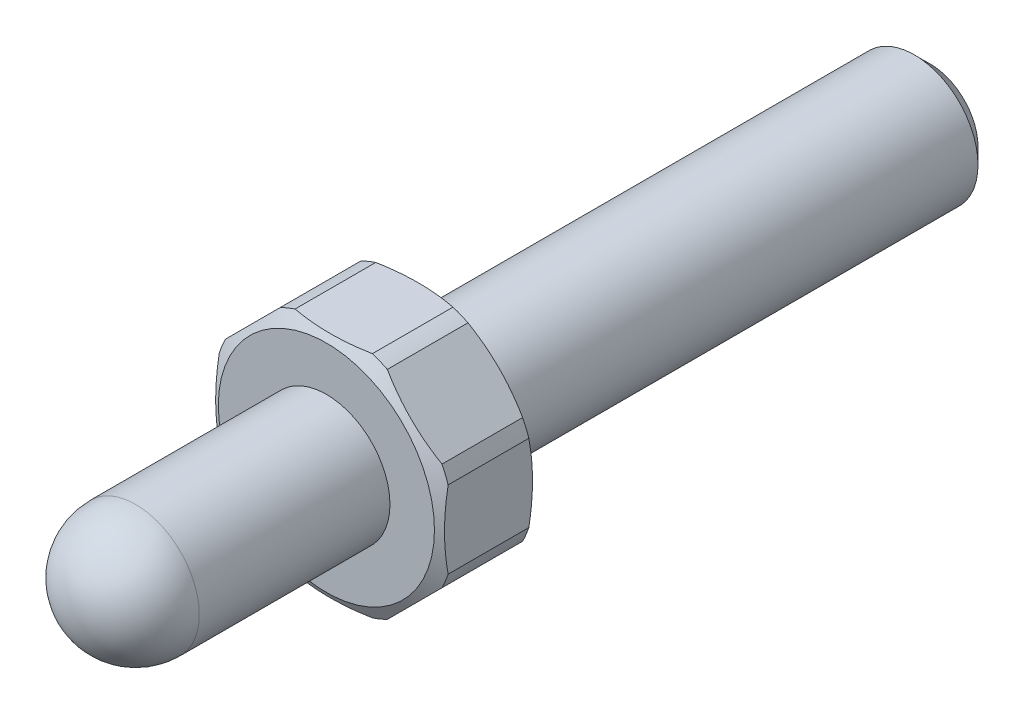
ISO-10303-21;
HEADER;
FILE_DESCRIPTION(('STEP AP214'),'2;1');
FILE_NAME('part.step','',(''),(''),'','','');
FILE_SCHEMA(('AUTOMOTIVE_DESIGN { 1 0 10303 214 1 1 1 1 }'));
ENDSEC;
DATA;
#1=APPLICATION_CONTEXT('core data for automotive mechanical design processes');
#2=APPLICATION_PROTOCOL_DEFINITION('international standard','automotive_design',2000,#1);
#3=PRODUCT_CONTEXT('',#1,'mechanical');
#4=PRODUCT('Part','Part','',(#3));
#5=PRODUCT_RELATED_PRODUCT_CATEGORY('part','',(#4));
#6=PRODUCT_DEFINITION_FORMATION('','',#4);
#7=PRODUCT_DEFINITION_CONTEXT('part definition',#1,'design');
#8=PRODUCT_DEFINITION('design','',#6,#7);
#9=PRODUCT_DEFINITION_SHAPE('','',#8);
#10=(LENGTH_UNIT() NAMED_UNIT(*) SI_UNIT(.MILLI.,.METRE.));
#11=(NAMED_UNIT(*) PLANE_ANGLE_UNIT() SI_UNIT($,.RADIAN.));
#12=(NAMED_UNIT(*) SI_UNIT($,.STERADIAN.) SOLID_ANGLE_UNIT());
#13=UNCERTAINTY_MEASURE_WITH_UNIT(LENGTH_MEASURE(1.E-05),#10,'distance_accuracy_value','');
#14=(GEOMETRIC_REPRESENTATION_CONTEXT(3) GLOBAL_UNCERTAINTY_ASSIGNED_CONTEXT((#13)) GLOBAL_UNIT_ASSIGNED_CONTEXT((#10,
#11,#12)) REPRESENTATION_CONTEXT('',''));
#15=CARTESIAN_POINT('',(0.,0.,0.));
#16=DIRECTION('',(0.,0.,1.));
#17=DIRECTION('',(1.,0.,0.));
#18=AXIS2_PLACEMENT_3D('',#15,#16,#17);
#19=CARTESIAN_POINT('',(-18.,7.45584412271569,95.));
#20=DIRECTION('',(-0.707106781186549,0.707106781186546,0.));
#21=DIRECTION('',(-0.707106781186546,-0.707106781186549,0.));
#22=AXIS2_PLACEMENT_3D('',#19,#20,#21);
#23=PLANE('',#22);
#24=CARTESIAN_POINT('',(-17.0292846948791,8.42655942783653,81.1547528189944));
#25=CARTESIAN_POINT('',(-16.7274170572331,8.7284270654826,81.0758082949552));
#26=CARTESIAN_POINT('',(-16.4245693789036,9.03127474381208,81.0041272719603));
#27=CARTESIAN_POINT('',(-15.8171697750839,9.63867434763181,80.8764009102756));
#28=CARTESIAN_POINT('',(-15.5126175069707,9.94322661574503,80.8203588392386));
#29=CARTESIAN_POINT('',(-14.9021152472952,10.5537288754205,80.7250411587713));
#30=CARTESIAN_POINT('',(-14.5961649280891,10.8596791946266,80.6857697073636));
#31=CARTESIAN_POINT('',(-13.9834090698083,11.4724350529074,80.6248351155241));
#32=CARTESIAN_POINT('',(-13.6766036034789,11.7792405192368,80.6031705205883));
#33=CARTESIAN_POINT('',(-13.0669643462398,12.3888797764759,80.5781066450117));
#34=CARTESIAN_POINT('',(-12.7641358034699,12.6917083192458,80.574453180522));
#35=CARTESIAN_POINT('',(-12.1586149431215,13.2972291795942,80.584804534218));
#36=CARTESIAN_POINT('',(-11.8559226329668,13.5999214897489,80.5988102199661));
#37=CARTESIAN_POINT('',(-11.2513634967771,14.2044806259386,80.6441613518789));
#38=CARTESIAN_POINT('',(-10.9494963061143,14.5063478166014,80.6754971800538));
#39=CARTESIAN_POINT('',(-10.3468904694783,15.1089536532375,80.7548419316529));
#40=CARTESIAN_POINT('',(-10.0461517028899,15.4096924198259,80.8028490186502));
#41=CARTESIAN_POINT('',(-9.63590506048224,15.8199390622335,80.879250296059));
#42=CARTESIAN_POINT('',(-9.52574484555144,15.9300992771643,80.9008465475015));
#43=CARTESIAN_POINT('',(-9.30564817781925,16.1501959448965,80.9461055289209));
#44=CARTESIAN_POINT('',(-9.19571170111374,16.260132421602,80.9697680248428));
#45=CARTESIAN_POINT('',(-8.97577054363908,16.4800735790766,81.0191715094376));
#46=CARTESIAN_POINT('',(-8.86576647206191,16.5900776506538,81.0449179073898));
#47=CARTESIAN_POINT('',(-8.64598646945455,16.8098576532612,81.0983764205));
#48=CARTESIAN_POINT('',(-8.53621056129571,16.91963356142,81.1260887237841));
#49=CARTESIAN_POINT('',(-8.4265594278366,17.0292846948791,81.1547528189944));
#50=B_SPLINE_CURVE_WITH_KNOTS('',3,(#24,#25,#26,#27,#28,#29,#30,#31,#32,#33,#34,#35,#36,#37,#38,
#39,#40,#41,#42,#43,#44,#45,#46,#47,#48,#49),.UNSPECIFIED.,.F.,.F.,(4,2,2,2,2,2,2,2,2,2,2,2,4),
(0.,1.30242981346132,2.60513155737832,3.90815609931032,5.21107298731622,6.49554862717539,
7.7800873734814,9.06391393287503,10.3475991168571,10.8194295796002,11.291206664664,
11.7642502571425,12.2373391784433),.UNSPECIFIED.);
#51=CARTESIAN_POINT('',(-17.0290846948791,8.42675942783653,81.1547005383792));
#52=VERTEX_POINT('',#51);
#53=CARTESIAN_POINT('',(-8.4267594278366,17.0290846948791,81.1547005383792));
#54=VERTEX_POINT('',#53);
#55=EDGE_CURVE('E210',#52,#54,#50,.T.);
#56=ORIENTED_EDGE('',*,*,#55,.F.);
#57=DIRECTION('',(0.,0.,-1.));
#58=VECTOR('',#57,1.);
#59=CARTESIAN_POINT('',(-17.0290846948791,8.42675942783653,26.8038594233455));
#60=LINE('',#59,#58);
#61=CARTESIAN_POINT('',(-17.0290846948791,8.42675942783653,93.8452994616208));
#62=VERTEX_POINT('',#61);
#63=EDGE_CURVE('E311',#62,#52,#60,.T.);
#64=ORIENTED_EDGE('',*,*,#63,.F.);
#65=CARTESIAN_POINT('',(-8.4265594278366,17.0292846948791,93.8452471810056));
#66=CARTESIAN_POINT('',(-8.72842706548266,16.7274170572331,93.9241917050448));
#67=CARTESIAN_POINT('',(-9.03127474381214,16.4245693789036,93.9958727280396));
#68=CARTESIAN_POINT('',(-9.63867434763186,15.8171697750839,94.1235990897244));
#69=CARTESIAN_POINT('',(-9.94322661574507,15.5126175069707,94.1796411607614));
#70=CARTESIAN_POINT('',(-10.5537288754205,14.9021152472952,94.2749588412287));
#71=CARTESIAN_POINT('',(-10.8596791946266,14.5961649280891,94.3142302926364));
#72=CARTESIAN_POINT('',(-11.4724350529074,13.9834090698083,94.3751648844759));
#73=CARTESIAN_POINT('',(-11.7792405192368,13.6766036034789,94.3968294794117));
#74=CARTESIAN_POINT('',(-12.3888797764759,13.0669643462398,94.4218933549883));
#75=CARTESIAN_POINT('',(-12.6917083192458,12.7641358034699,94.425546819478));
#76=CARTESIAN_POINT('',(-13.2972291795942,12.1586149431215,94.415195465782));
#77=CARTESIAN_POINT('',(-13.5999214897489,11.8559226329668,94.4011897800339));
#78=CARTESIAN_POINT('',(-14.2044806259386,11.2513634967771,94.355838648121));
#79=CARTESIAN_POINT('',(-14.5063478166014,10.9494963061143,94.3245028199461));
#80=CARTESIAN_POINT('',(-15.1089536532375,10.3468904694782,94.2451580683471));
#81=CARTESIAN_POINT('',(-15.4096924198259,10.0461517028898,94.1971509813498));
#82=CARTESIAN_POINT('',(-15.8199390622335,9.63590506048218,94.120749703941));
#83=CARTESIAN_POINT('',(-15.9300992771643,9.52574484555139,94.0991534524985));
#84=CARTESIAN_POINT('',(-16.1501959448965,9.30564817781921,94.0538944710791));
#85=CARTESIAN_POINT('',(-16.260132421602,9.19571170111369,94.0302319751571));
#86=CARTESIAN_POINT('',(-16.4800735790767,8.97577054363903,93.9808284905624));
#87=CARTESIAN_POINT('',(-16.5900776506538,8.86576647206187,93.9550820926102));
#88=CARTESIAN_POINT('',(-16.8098576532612,8.6459864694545,93.9016235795));
#89=CARTESIAN_POINT('',(-16.91963356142,8.53621056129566,93.8739112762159));
#90=CARTESIAN_POINT('',(-17.0292846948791,8.42655942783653,93.8452471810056));
#91=B_SPLINE_CURVE_WITH_KNOTS('',3,(#65,#66,#67,#68,#69,#70,#71,#72,#73,#74,#75,#76,#77,#78,#79,
#80,#81,#82,#83,#84,#85,#86,#87,#88,#89,#90),.UNSPECIFIED.,.F.,.F.,(4,2,2,2,2,2,2,2,2,2,2,2,4),
(0.,1.30242981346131,2.60513155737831,3.90815609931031,5.21107298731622,6.49554862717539,
7.7800873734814,9.06391393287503,10.3475991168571,10.8194295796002,11.291206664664,
11.7642502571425,12.2373391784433),.UNSPECIFIED.);
#92=CARTESIAN_POINT('',(-8.4267594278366,17.0290846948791,93.8452994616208));
#93=VERTEX_POINT('',#92);
#94=EDGE_CURVE('E202',#93,#62,#91,.T.);
#95=ORIENTED_EDGE('',*,*,#94,.F.);
#96=DIRECTION('',(0.,0.,-1.));
#97=VECTOR('',#96,1.);
#98=CARTESIAN_POINT('',(-8.4267594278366,17.0290846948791,26.8038594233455));
#99=LINE('',#98,#97);
#100=EDGE_CURVE('E317',#54,#93,#99,.F.);
#101=ORIENTED_EDGE('',*,*,#100,.F.);
#102=EDGE_LOOP('',(#56,#64,#95,#101));
#103=FACE_BOUND('',#102,.T.);
#104=ADVANCED_FACE('F14',(#103),#23,.T.);
#105=CARTESIAN_POINT('',(-18.,7.45584412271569,95.));
#106=DIRECTION('',(1.,0.,0.));
#107=DIRECTION('',(0.,0.,-1.));
#108=AXIS2_PLACEMENT_3D('',#105,#106,#107);
#109=PLANE('',#108);
#110=DIRECTION('',(0.,0.,-1.));
#111=VECTOR('',#110,1.);
#112=CARTESIAN_POINT('',(-18.,6.08276253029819,26.8038594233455));
#113=LINE('',#112,#111);
#114=CARTESIAN_POINT('',(-18.,6.08276253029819,93.8452994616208));
#115=VERTEX_POINT('',#114);
#116=CARTESIAN_POINT('',(-18.,6.08276253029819,81.1547005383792));
#117=VERTEX_POINT('',#116);
#118=EDGE_CURVE('E134',#115,#117,#113,.T.);
#119=ORIENTED_EDGE('',*,*,#118,.T.);
#120=CARTESIAN_POINT('',(-18.,-20.6335541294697,85.9937303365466));
#121=CARTESIAN_POINT('',(-18.,-20.3117166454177,85.8537128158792));
#122=CARTESIAN_POINT('',(-18.,-19.9893645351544,85.7148792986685));
#123=CARTESIAN_POINT('',(-18.,-19.3435399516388,85.4398255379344));
#124=CARTESIAN_POINT('',(-18.,-19.0200674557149,85.3036053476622));
#125=CARTESIAN_POINT('',(-18.,-18.0476897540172,84.8991735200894));
#126=CARTESIAN_POINT('',(-18.,-17.3969857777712,84.635261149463));
#127=CARTESIAN_POINT('',(-18.,-16.0863459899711,84.1198815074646));
#128=CARTESIAN_POINT('',(-18.,-15.4263786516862,83.8684941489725));
#129=CARTESIAN_POINT('',(-18.,-14.1001650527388,83.3829209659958));
#130=CARTESIAN_POINT('',(-18.,-13.433919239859,83.1487339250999));
#131=CARTESIAN_POINT('',(-18.,-12.1057091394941,82.7051591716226));
#132=CARTESIAN_POINT('',(-18.,-11.4438633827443,82.4954186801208));
#133=CARTESIAN_POINT('',(-18.,-10.112748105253,82.1006052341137));
#134=CARTESIAN_POINT('',(-18.,-9.44347813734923,81.9155337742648));
#135=CARTESIAN_POINT('',(-18.,-8.0987896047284,81.5754794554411));
#136=CARTESIAN_POINT('',(-18.,-7.42338718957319,81.4204332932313));
#137=CARTESIAN_POINT('',(-18.,-6.06549999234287,81.1453784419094));
#138=CARTESIAN_POINT('',(-18.,-5.3830167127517,81.0253624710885));
#139=CARTESIAN_POINT('',(-18.,-4.28064358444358,80.8646351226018));
#140=CARTESIAN_POINT('',(-18.,-3.8625773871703,80.8112723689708));
#141=CARTESIAN_POINT('',(-18.,-3.02473705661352,80.7203803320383));
#142=CARTESIAN_POINT('',(-18.,-2.60496304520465,80.6828499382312));
#143=CARTESIAN_POINT('',(-18.,-1.76417971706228,80.6243643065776));
#144=CARTESIAN_POINT('',(-18.,-1.34317018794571,80.60341210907));
#145=CARTESIAN_POINT('',(-18.,-0.500640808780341,80.5785314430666));
#146=CARTESIAN_POINT('',(-18.,-0.0791209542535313,80.5746031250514));
#147=CARTESIAN_POINT('',(-18.,0.76533962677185,80.5838730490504));
#148=CARTESIAN_POINT('',(-18.,1.18827963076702,80.5971367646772));
#149=CARTESIAN_POINT('',(-18.,2.03327965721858,80.6406200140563));
#150=CARTESIAN_POINT('',(-18.,2.45533968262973,80.6708394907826));
#151=CARTESIAN_POINT('',(-18.,3.2978157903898,80.7475988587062));
#152=CARTESIAN_POINT('',(-18.,3.71823239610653,80.7941330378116));
#153=CARTESIAN_POINT('',(-18.,4.55709884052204,80.9026320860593));
#154=CARTESIAN_POINT('',(-18.,4.97554847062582,80.9645985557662));
#155=CARTESIAN_POINT('',(-18.,5.90932762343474,81.1193242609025));
#156=CARTESIAN_POINT('',(-18.,6.42402467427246,81.2159019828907));
#157=CARTESIAN_POINT('',(-18.,7.44933560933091,81.4287642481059));
#158=CARTESIAN_POINT('',(-18.,7.95994914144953,81.5450504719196));
#159=CARTESIAN_POINT('',(-18.,8.9771829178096,81.7950675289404));
#160=CARTESIAN_POINT('',(-18.,9.48380062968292,81.9288086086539));
#161=CARTESIAN_POINT('',(-18.,10.4927627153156,82.2114532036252));
#162=CARTESIAN_POINT('',(-18.,10.9951071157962,82.3603566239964));
#163=CARTESIAN_POINT('',(-18.,11.9980307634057,82.6720157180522));
#164=CARTESIAN_POINT('',(-18.,12.4985908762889,82.8348327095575));
#165=CARTESIAN_POINT('',(-18.,13.495837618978,83.1718876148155));
#166=CARTESIAN_POINT('',(-18.,13.992524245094,83.3461255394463));
#167=CARTESIAN_POINT('',(-18.,14.9822020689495,83.7043873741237));
#168=CARTESIAN_POINT('',(-18.,15.4751941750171,83.8884087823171));
#169=CARTESIAN_POINT('',(-18.,16.4579267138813,84.264915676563));
#170=CARTESIAN_POINT('',(-18.,16.9476671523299,84.4574011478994));
#171=CARTESIAN_POINT('',(-18.,17.9255787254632,84.8502274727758));
#172=CARTESIAN_POINT('',(-18.,18.413741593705,85.0505888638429));
#173=CARTESIAN_POINT('',(-18.,19.3874144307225,85.4576693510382));
#174=CARTESIAN_POINT('',(-18.,19.8729243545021,85.6643885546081));
#175=CARTESIAN_POINT('',(-18.,20.8415884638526,86.083356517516));
#176=CARTESIAN_POINT('',(-18.,21.3247424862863,86.2956056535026));
#177=CARTESIAN_POINT('',(-18.,22.2889110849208,86.7249102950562));
#178=CARTESIAN_POINT('',(-18.,22.7699256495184,86.9419658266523));
#179=CARTESIAN_POINT('',(-18.,23.7245299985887,87.377766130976));
#180=CARTESIAN_POINT('',(-18.,24.1981416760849,87.5964629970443));
#181=CARTESIAN_POINT('',(-18.,25.143680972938,88.0374689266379));
#182=CARTESIAN_POINT('',(-18.,25.6156085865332,88.2597780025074));
#183=CARTESIAN_POINT('',(-18.,26.55781853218,88.7075190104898));
#184=CARTESIAN_POINT('',(-18.,27.0281012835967,88.932950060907));
#185=CARTESIAN_POINT('',(-18.,27.967292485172,89.3866394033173));
#186=CARTESIAN_POINT('',(-18.,28.4362009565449,89.6148976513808));
#187=CARTESIAN_POINT('',(-18.,28.9044994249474,89.8443950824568));
#188=B_SPLINE_CURVE_WITH_KNOTS('',3,(#120,#121,#122,#123,#124,#125,#126,#127,#128,#129,#130,
#131,#132,#133,#134,#135,#136,#137,#138,#139,#140,#141,#142,#143,#144,#145,#146,#147,#148,#149,
#150,#151,#152,#153,#154,#155,#156,#157,#158,#159,#160,#161,#162,#163,#164,#165,#166,#167,#168,
#169,#170,#171,#172,#173,#174,#175,#176,#177,#178,#179,#180,#181,#182,#183,#184,#185,#186,#187),
.UNSPECIFIED.,.F.,.F.,(4,2,2,2,2,2,2,2,2,2,2,2,2,2,2,2,2,2,2,2,2,2,2,2,2,2,2,2,2,2,2,2,2,4),(0.,
1.052924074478,2.10586958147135,4.21228905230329,6.33076978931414,8.4491005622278,
10.531561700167,12.6141489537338,14.6922964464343,16.7700116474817,18.0341237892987,
19.2981472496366,20.5624024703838,21.8266688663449,23.0957642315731,24.3648553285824,
25.6335025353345,26.9022813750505,28.4728710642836,30.0435947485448,31.6152446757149,
33.18688476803,34.7658486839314,36.344814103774,37.9233776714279,39.5019384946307,
41.0849312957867,42.6679508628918,44.2510785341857,45.8342147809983,47.3991983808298,
48.9641873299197,50.5287429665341,52.093274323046),.UNSPECIFIED.);
#189=CARTESIAN_POINT('',(-18.,-6.08276253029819,81.1547005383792));
#190=VERTEX_POINT('',#189);
#191=EDGE_CURVE('E126',#117,#190,#188,.F.);
#192=ORIENTED_EDGE('',*,*,#191,.T.);
#193=DIRECTION('',(0.,0.,-1.));
#194=VECTOR('',#193,1.);
#195=CARTESIAN_POINT('',(-18.,-6.08276253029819,26.8038594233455));
#196=LINE('',#195,#194);
#197=CARTESIAN_POINT('',(-18.,-6.08276253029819,93.8452994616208));
#198=VERTEX_POINT('',#197);
#199=EDGE_CURVE('E36',#190,#198,#196,.F.);
#200=ORIENTED_EDGE('',*,*,#199,.T.);
#201=CARTESIAN_POINT('',(-18.,-20.6335541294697,89.0062696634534));
#202=CARTESIAN_POINT('',(-18.,-20.3117166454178,89.1462871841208));
#203=CARTESIAN_POINT('',(-18.,-19.9893645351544,89.2851207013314));
#204=CARTESIAN_POINT('',(-18.,-19.3435399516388,89.5601744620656));
#205=CARTESIAN_POINT('',(-18.,-19.0200674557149,89.6963946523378));
#206=CARTESIAN_POINT('',(-18.,-18.0476897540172,90.1008264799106));
#207=CARTESIAN_POINT('',(-18.,-17.3969857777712,90.364738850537));
#208=CARTESIAN_POINT('',(-18.,-16.0863459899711,90.8801184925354));
#209=CARTESIAN_POINT('',(-18.,-15.4263786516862,91.1315058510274));
#210=CARTESIAN_POINT('',(-18.,-14.1001650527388,91.6170790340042));
#211=CARTESIAN_POINT('',(-18.,-13.433919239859,91.8512660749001));
#212=CARTESIAN_POINT('',(-18.,-12.1057091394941,92.2948408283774));
#213=CARTESIAN_POINT('',(-18.,-11.4438633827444,92.5045813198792));
#214=CARTESIAN_POINT('',(-18.,-10.112748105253,92.8993947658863));
#215=CARTESIAN_POINT('',(-18.,-9.44347813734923,93.0844662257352));
#216=CARTESIAN_POINT('',(-18.,-8.0987896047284,93.4245205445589));
#217=CARTESIAN_POINT('',(-18.,-7.42338718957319,93.5795667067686));
#218=CARTESIAN_POINT('',(-18.,-6.06549999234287,93.8546215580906));
#219=CARTESIAN_POINT('',(-18.,-5.3830167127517,93.9746375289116));
#220=CARTESIAN_POINT('',(-18.,-4.28064358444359,94.1353648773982));
#221=CARTESIAN_POINT('',(-18.,-3.8625773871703,94.1887276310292));
#222=CARTESIAN_POINT('',(-18.,-3.02473705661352,94.2796196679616));
#223=CARTESIAN_POINT('',(-18.,-2.60496304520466,94.3171500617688));
#224=CARTESIAN_POINT('',(-18.,-1.76417971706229,94.3756356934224));
#225=CARTESIAN_POINT('',(-18.,-1.34317018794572,94.39658789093));
#226=CARTESIAN_POINT('',(-18.,-0.500640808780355,94.4214685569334));
#227=CARTESIAN_POINT('',(-18.,-0.0791209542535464,94.4253968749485));
#228=CARTESIAN_POINT('',(-18.,0.765339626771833,94.4161269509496));
#229=CARTESIAN_POINT('',(-18.,1.18827963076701,94.4028632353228));
#230=CARTESIAN_POINT('',(-18.,2.03327965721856,94.3593799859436));
#231=CARTESIAN_POINT('',(-18.,2.45533968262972,94.3291605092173));
#232=CARTESIAN_POINT('',(-18.,3.29781579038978,94.2524011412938));
#233=CARTESIAN_POINT('',(-18.,3.71823239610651,94.2058669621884));
#234=CARTESIAN_POINT('',(-18.,4.55709884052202,94.0973679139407));
#235=CARTESIAN_POINT('',(-18.,4.9755484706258,94.0354014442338));
#236=CARTESIAN_POINT('',(-18.,5.90932762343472,93.8806757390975));
#237=CARTESIAN_POINT('',(-18.,6.42402467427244,93.7840980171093));
#238=CARTESIAN_POINT('',(-18.,7.44933560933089,93.5712357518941));
#239=CARTESIAN_POINT('',(-18.,7.9599491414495,93.4549495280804));
#240=CARTESIAN_POINT('',(-18.,8.97718291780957,93.2049324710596));
#241=CARTESIAN_POINT('',(-18.,9.48380062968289,93.0711913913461));
#242=CARTESIAN_POINT('',(-18.,10.4927627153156,92.7885467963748));
#243=CARTESIAN_POINT('',(-18.,10.9951071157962,92.6396433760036));
#244=CARTESIAN_POINT('',(-18.,11.9980307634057,92.3279842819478));
#245=CARTESIAN_POINT('',(-18.,12.4985908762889,92.1651672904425));
#246=CARTESIAN_POINT('',(-18.,13.495837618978,91.8281123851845));
#247=CARTESIAN_POINT('',(-18.,13.992524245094,91.6538744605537));
#248=CARTESIAN_POINT('',(-18.,14.9822020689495,91.2956126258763));
#249=CARTESIAN_POINT('',(-18.,15.475194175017,91.1115912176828));
#250=CARTESIAN_POINT('',(-18.,16.4579267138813,90.735084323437));
#251=CARTESIAN_POINT('',(-18.,16.9476671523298,90.5425988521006));
#252=CARTESIAN_POINT('',(-18.,17.9255787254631,90.1497725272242));
#253=CARTESIAN_POINT('',(-18.,18.413741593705,89.9494111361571));
#254=CARTESIAN_POINT('',(-18.,19.3874144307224,89.5423306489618));
#255=CARTESIAN_POINT('',(-18.,19.8729243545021,89.3356114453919));
#256=CARTESIAN_POINT('',(-18.,20.8415884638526,88.916643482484));
#257=CARTESIAN_POINT('',(-18.,21.3247424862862,88.7043943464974));
#258=CARTESIAN_POINT('',(-18.,22.2889110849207,88.2750897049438));
#259=CARTESIAN_POINT('',(-18.,22.7699256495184,88.0580341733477));
#260=CARTESIAN_POINT('',(-18.,23.7245299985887,87.622233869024));
#261=CARTESIAN_POINT('',(-18.,24.1981416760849,87.4035370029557));
#262=CARTESIAN_POINT('',(-18.,25.143680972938,86.9625310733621));
#263=CARTESIAN_POINT('',(-18.,25.6156085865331,86.7402219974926));
#264=CARTESIAN_POINT('',(-18.,26.55781853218,86.2924809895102));
#265=CARTESIAN_POINT('',(-18.,27.0281012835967,86.0670499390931));
#266=CARTESIAN_POINT('',(-18.,27.967292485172,85.6133605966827));
#267=CARTESIAN_POINT('',(-18.,28.4362009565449,85.3851023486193));
#268=CARTESIAN_POINT('',(-18.,28.9044994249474,85.1556049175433));
#269=B_SPLINE_CURVE_WITH_KNOTS('',3,(#201,#202,#203,#204,#205,#206,#207,#208,#209,#210,#211,
#212,#213,#214,#215,#216,#217,#218,#219,#220,#221,#222,#223,#224,#225,#226,#227,#228,#229,#230,
#231,#232,#233,#234,#235,#236,#237,#238,#239,#240,#241,#242,#243,#244,#245,#246,#247,#248,#249,
#250,#251,#252,#253,#254,#255,#256,#257,#258,#259,#260,#261,#262,#263,#264,#265,#266,#267,#268),
.UNSPECIFIED.,.F.,.F.,(4,2,2,2,2,2,2,2,2,2,2,2,2,2,2,2,2,2,2,2,2,2,2,2,2,2,2,2,2,2,2,2,2,4),(0.,
1.052924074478,2.10586958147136,4.21228905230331,6.33076978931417,8.44910056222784,
10.531561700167,12.6141489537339,14.6922964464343,16.7700116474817,18.0341237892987,
19.2981472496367,20.5624024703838,21.8266688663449,23.0957642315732,24.3648553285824,
25.6335025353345,26.9022813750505,28.4728710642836,30.0435947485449,31.6152446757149,
33.18688476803,34.7658486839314,36.344814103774,37.9233776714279,39.5019384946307,
41.0849312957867,42.6679508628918,44.2510785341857,45.8342147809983,47.3991983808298,
48.9641873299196,50.5287429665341,52.093274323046),.UNSPECIFIED.);
#270=EDGE_CURVE('E353',#198,#115,#269,.T.);
#271=ORIENTED_EDGE('',*,*,#270,.T.);
#272=EDGE_LOOP('',(#119,#192,#200,#271));
#273=FACE_BOUND('',#272,.T.);
#274=ADVANCED_FACE('F132',(#273),#109,.F.);
#275=CARTESIAN_POINT('',(-18.,-7.45584412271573,95.));
#276=DIRECTION('',(0.707106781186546,0.707106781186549,0.));
#277=DIRECTION('',(-0.707106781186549,0.707106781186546,0.));
#278=AXIS2_PLACEMENT_3D('',#275,#276,#277);
#279=PLANE('',#278);
#280=DIRECTION('',(0.,0.,-1.));
#281=VECTOR('',#280,1.);
#282=CARTESIAN_POINT('',(-17.0290846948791,-8.42675942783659,26.8038594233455));
#283=LINE('',#282,#281);
#284=CARTESIAN_POINT('',(-17.0290846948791,-8.42675942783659,93.8452994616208));
#285=VERTEX_POINT('',#284);
#286=CARTESIAN_POINT('',(-17.0290846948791,-8.42675942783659,81.1547005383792));
#287=VERTEX_POINT('',#286);
#288=EDGE_CURVE('E140',#285,#287,#283,.T.);
#289=ORIENTED_EDGE('',*,*,#288,.T.);
#290=CARTESIAN_POINT('',(-17.0292846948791,-8.42655942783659,81.1547528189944));
#291=CARTESIAN_POINT('',(-16.7274170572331,-8.72842706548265,81.0758082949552));
#292=CARTESIAN_POINT('',(-16.4245693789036,-9.03127474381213,81.0041272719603));
#293=CARTESIAN_POINT('',(-15.8171697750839,-9.63867434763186,80.8764009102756));
#294=CARTESIAN_POINT('',(-15.5126175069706,-9.94322661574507,80.8203588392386));
#295=CARTESIAN_POINT('',(-14.9021152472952,-10.5537288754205,80.7250411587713));
#296=CARTESIAN_POINT('',(-14.5961649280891,-10.8596791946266,80.6857697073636));
#297=CARTESIAN_POINT('',(-13.9834090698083,-11.4724350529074,80.6248351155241));
#298=CARTESIAN_POINT('',(-13.6766036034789,-11.7792405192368,80.6031705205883));
#299=CARTESIAN_POINT('',(-13.0669643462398,-12.3888797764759,80.5781066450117));
#300=CARTESIAN_POINT('',(-12.7641358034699,-12.6917083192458,80.574453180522));
#301=CARTESIAN_POINT('',(-12.1586149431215,-13.2972291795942,80.584804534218));
#302=CARTESIAN_POINT('',(-11.8559226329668,-13.5999214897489,80.5988102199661));
#303=CARTESIAN_POINT('',(-11.2513634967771,-14.2044806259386,80.6441613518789));
#304=CARTESIAN_POINT('',(-10.9494963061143,-14.5063478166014,80.6754971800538));
#305=CARTESIAN_POINT('',(-10.3468904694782,-15.1089536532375,80.7548419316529));
#306=CARTESIAN_POINT('',(-10.0461517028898,-15.4096924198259,80.8028490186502));
#307=CARTESIAN_POINT('',(-9.63590506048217,-15.8199390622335,80.879250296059));
#308=CARTESIAN_POINT('',(-9.52574484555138,-15.9300992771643,80.9008465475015));
#309=CARTESIAN_POINT('',(-9.3056481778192,-16.1501959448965,80.9461055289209));
#310=CARTESIAN_POINT('',(-9.19571170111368,-16.260132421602,80.9697680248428));
#311=CARTESIAN_POINT('',(-8.97577054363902,-16.4800735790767,81.0191715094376));
#312=CARTESIAN_POINT('',(-8.86576647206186,-16.5900776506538,81.0449179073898));
#313=CARTESIAN_POINT('',(-8.64598646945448,-16.8098576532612,81.0983764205));
#314=CARTESIAN_POINT('',(-8.53621056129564,-16.91963356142,81.1260887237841));
#315=CARTESIAN_POINT('',(-8.42655942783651,-17.0292846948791,81.1547528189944));
#316=B_SPLINE_CURVE_WITH_KNOTS('',3,(#290,#291,#292,#293,#294,#295,#296,#297,#298,#299,#300,
#301,#302,#303,#304,#305,#306,#307,#308,#309,#310,#311,#312,#313,#314,#315),.UNSPECIFIED.,.F.,
.F.,(4,2,2,2,2,2,2,2,2,2,2,2,4),(0.,1.30242981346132,2.60513155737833,3.90815609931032,
5.21107298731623,6.4955486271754,7.7800873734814,9.06391393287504,10.3475991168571,
10.8194295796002,11.291206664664,11.7642502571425,12.2373391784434),.UNSPECIFIED.);
#317=CARTESIAN_POINT('',(-8.42675942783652,-17.0290846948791,81.1547005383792));
#318=VERTEX_POINT('',#317);
#319=EDGE_CURVE('E29',#287,#318,#316,.T.);
#320=ORIENTED_EDGE('',*,*,#319,.T.);
#321=DIRECTION('',(0.,0.,-1.));
#322=VECTOR('',#321,1.);
#323=CARTESIAN_POINT('',(-8.42675942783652,-17.0290846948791,26.8038594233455));
#324=LINE('',#323,#322);
#325=CARTESIAN_POINT('',(-8.42675942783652,-17.0290846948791,93.8452994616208));
#326=VERTEX_POINT('',#325);
#327=EDGE_CURVE('E145',#318,#326,#324,.F.);
#328=ORIENTED_EDGE('',*,*,#327,.T.);
#329=CARTESIAN_POINT('',(-8.42655942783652,-17.0292846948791,93.8452471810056));
#330=CARTESIAN_POINT('',(-8.72842706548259,-16.7274170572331,93.9241917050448));
#331=CARTESIAN_POINT('',(-9.03127474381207,-16.4245693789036,93.9958727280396));
#332=CARTESIAN_POINT('',(-9.6386743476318,-15.8171697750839,94.1235990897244));
#333=CARTESIAN_POINT('',(-9.94322661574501,-15.5126175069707,94.1796411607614));
#334=CARTESIAN_POINT('',(-10.5537288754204,-14.9021152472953,94.2749588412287));
#335=CARTESIAN_POINT('',(-10.8596791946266,-14.5961649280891,94.3142302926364));
#336=CARTESIAN_POINT('',(-11.4724350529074,-13.9834090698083,94.3751648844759));
#337=CARTESIAN_POINT('',(-11.7792405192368,-13.6766036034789,94.3968294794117));
#338=CARTESIAN_POINT('',(-12.3888797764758,-13.0669643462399,94.4218933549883));
#339=CARTESIAN_POINT('',(-12.6917083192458,-12.7641358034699,94.425546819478));
#340=CARTESIAN_POINT('',(-13.2972291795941,-12.1586149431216,94.415195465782));
#341=CARTESIAN_POINT('',(-13.5999214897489,-11.8559226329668,94.4011897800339));
#342=CARTESIAN_POINT('',(-14.2044806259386,-11.2513634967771,94.355838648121));
#343=CARTESIAN_POINT('',(-14.5063478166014,-10.9494963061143,94.3245028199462));
#344=CARTESIAN_POINT('',(-15.1089536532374,-10.3468904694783,94.2451580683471));
#345=CARTESIAN_POINT('',(-15.4096924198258,-10.0461517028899,94.1971509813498));
#346=CARTESIAN_POINT('',(-15.8199390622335,-9.63590506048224,94.120749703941));
#347=CARTESIAN_POINT('',(-15.9300992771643,-9.52574484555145,94.0991534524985));
#348=CARTESIAN_POINT('',(-16.1501959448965,-9.30564817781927,94.0538944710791));
#349=CARTESIAN_POINT('',(-16.260132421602,-9.19571170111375,94.0302319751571));
#350=CARTESIAN_POINT('',(-16.4800735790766,-8.97577054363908,93.9808284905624));
#351=CARTESIAN_POINT('',(-16.5900776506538,-8.86576647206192,93.9550820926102));
#352=CARTESIAN_POINT('',(-16.8098576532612,-8.64598646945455,93.9016235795));
#353=CARTESIAN_POINT('',(-16.91963356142,-8.53621056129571,93.8739112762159));
#354=CARTESIAN_POINT('',(-17.0292846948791,-8.42655942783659,93.8452471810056));
#355=B_SPLINE_CURVE_WITH_KNOTS('',3,(#329,#330,#331,#332,#333,#334,#335,#336,#337,#338,#339,
#340,#341,#342,#343,#344,#345,#346,#347,#348,#349,#350,#351,#352,#353,#354),.UNSPECIFIED.,.F.,
.F.,(4,2,2,2,2,2,2,2,2,2,2,2,4),(0.,1.30242981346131,2.6051315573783,3.90815609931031,
5.21107298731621,6.49554862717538,7.78008737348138,9.063913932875,10.3475991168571,
10.8194295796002,11.291206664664,11.7642502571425,12.2373391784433),.UNSPECIFIED.);
#356=EDGE_CURVE('E344',#326,#285,#355,.T.);
#357=ORIENTED_EDGE('',*,*,#356,.T.);
#358=EDGE_LOOP('',(#289,#320,#328,#357));
#359=FACE_BOUND('',#358,.T.);
#360=ADVANCED_FACE('F190',(#359),#279,.F.);
#361=CARTESIAN_POINT('',(7.45584412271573,-18.,95.));
#362=DIRECTION('',(0.,-1.,0.));
#363=DIRECTION('',(1.,0.,0.));
#364=AXIS2_PLACEMENT_3D('',#361,#362,#363);
#365=PLANE('',#364);
#366=CARTESIAN_POINT('',(-20.6335541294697,-18.,85.9937303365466));
#367=CARTESIAN_POINT('',(-20.3117166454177,-18.,85.8537128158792));
#368=CARTESIAN_POINT('',(-19.9893645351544,-18.,85.7148792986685));
#369=CARTESIAN_POINT('',(-19.3435399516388,-18.,85.4398255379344));
#370=CARTESIAN_POINT('',(-19.0200674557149,-18.,85.3036053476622));
#371=CARTESIAN_POINT('',(-18.0476897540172,-18.,84.8991735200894));
#372=CARTESIAN_POINT('',(-17.3969857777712,-18.,84.635261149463));
#373=CARTESIAN_POINT('',(-16.0863459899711,-18.,84.1198815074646));
#374=CARTESIAN_POINT('',(-15.4263786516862,-18.,83.8684941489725));
#375=CARTESIAN_POINT('',(-14.1001650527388,-18.,83.3829209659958));
#376=CARTESIAN_POINT('',(-13.433919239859,-18.,83.1487339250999));
#377=CARTESIAN_POINT('',(-12.1057091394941,-18.,82.7051591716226));
#378=CARTESIAN_POINT('',(-11.4438633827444,-18.,82.4954186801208));
#379=CARTESIAN_POINT('',(-10.112748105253,-18.,82.1006052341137));
#380=CARTESIAN_POINT('',(-9.44347813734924,-18.,81.9155337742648));
#381=CARTESIAN_POINT('',(-8.09878960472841,-18.,81.5754794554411));
#382=CARTESIAN_POINT('',(-7.4233871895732,-18.,81.4204332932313));
#383=CARTESIAN_POINT('',(-6.06549999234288,-18.,81.1453784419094));
#384=CARTESIAN_POINT('',(-5.38301671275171,-18.,81.0253624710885));
#385=CARTESIAN_POINT('',(-4.28064358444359,-18.,80.8646351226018));
#386=CARTESIAN_POINT('',(-3.86257738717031,-18.,80.8112723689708));
#387=CARTESIAN_POINT('',(-3.02473705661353,-18.,80.7203803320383));
#388=CARTESIAN_POINT('',(-2.60496304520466,-18.,80.6828499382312));
#389=CARTESIAN_POINT('',(-1.76417971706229,-18.,80.6243643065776));
#390=CARTESIAN_POINT('',(-1.34317018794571,-18.,80.60341210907));
#391=CARTESIAN_POINT('',(-0.50064080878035,-18.,80.5785314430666));
#392=CARTESIAN_POINT('',(-0.0791209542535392,-18.,80.5746031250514));
#393=CARTESIAN_POINT('',(0.765339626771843,-18.,80.5838730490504));
#394=CARTESIAN_POINT('',(1.18827963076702,-18.,80.5971367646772));
#395=CARTESIAN_POINT('',(2.03327965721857,-18.,80.6406200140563));
#396=CARTESIAN_POINT('',(2.45533968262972,-18.,80.6708394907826));
#397=CARTESIAN_POINT('',(3.29781579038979,-18.,80.7475988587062));
#398=CARTESIAN_POINT('',(3.71823239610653,-18.,80.7941330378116));
#399=CARTESIAN_POINT('',(4.55709884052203,-18.,80.9026320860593));
#400=CARTESIAN_POINT('',(4.97554847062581,-18.,80.9645985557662));
#401=CARTESIAN_POINT('',(5.90932762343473,-18.,81.1193242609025));
#402=CARTESIAN_POINT('',(6.42402467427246,-18.,81.2159019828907));
#403=CARTESIAN_POINT('',(7.4493356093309,-18.,81.4287642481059));
#404=CARTESIAN_POINT('',(7.95994914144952,-18.,81.5450504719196));
#405=CARTESIAN_POINT('',(8.97718291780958,-18.,81.7950675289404));
#406=CARTESIAN_POINT('',(9.48380062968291,-18.,81.9288086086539));
#407=CARTESIAN_POINT('',(10.4927627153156,-18.,82.2114532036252));
#408=CARTESIAN_POINT('',(10.9951071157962,-18.,82.3603566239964));
#409=CARTESIAN_POINT('',(11.9980307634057,-18.,82.6720157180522));
#410=CARTESIAN_POINT('',(12.4985908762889,-18.,82.8348327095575));
#411=CARTESIAN_POINT('',(13.495837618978,-18.,83.1718876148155));
#412=CARTESIAN_POINT('',(13.992524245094,-18.,83.3461255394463));
#413=CARTESIAN_POINT('',(14.9822020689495,-18.,83.7043873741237));
#414=CARTESIAN_POINT('',(15.475194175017,-18.,83.8884087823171));
#415=CARTESIAN_POINT('',(16.4579267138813,-18.,84.264915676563));
#416=CARTESIAN_POINT('',(16.9476671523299,-18.,84.4574011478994));
#417=CARTESIAN_POINT('',(17.9255787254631,-18.,84.8502274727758));
#418=CARTESIAN_POINT('',(18.413741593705,-18.,85.0505888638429));
#419=CARTESIAN_POINT('',(19.3874144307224,-18.,85.4576693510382));
#420=CARTESIAN_POINT('',(19.8729243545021,-18.,85.6643885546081));
#421=CARTESIAN_POINT('',(20.8415884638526,-18.,86.083356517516));
#422=CARTESIAN_POINT('',(21.3247424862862,-18.,86.2956056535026));
#423=CARTESIAN_POINT('',(22.2889110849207,-18.,86.7249102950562));
#424=CARTESIAN_POINT('',(22.7699256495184,-18.,86.9419658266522));
#425=CARTESIAN_POINT('',(23.7245299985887,-18.,87.377766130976));
#426=CARTESIAN_POINT('',(24.1981416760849,-18.,87.5964629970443));
#427=CARTESIAN_POINT('',(25.143680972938,-18.,88.0374689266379));
#428=CARTESIAN_POINT('',(25.6156085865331,-18.,88.2597780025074));
#429=CARTESIAN_POINT('',(26.55781853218,-18.,88.7075190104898));
#430=CARTESIAN_POINT('',(27.0281012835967,-18.,88.932950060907));
#431=CARTESIAN_POINT('',(27.967292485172,-18.,89.3866394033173));
#432=CARTESIAN_POINT('',(28.4362009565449,-18.,89.6148976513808));
#433=CARTESIAN_POINT('',(28.9044994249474,-18.,89.8443950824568));
#434=B_SPLINE_CURVE_WITH_KNOTS('',3,(#366,#367,#368,#369,#370,#371,#372,#373,#374,#375,#376,
#377,#378,#379,#380,#381,#382,#383,#384,#385,#386,#387,#388,#389,#390,#391,#392,#393,#394,#395,
#396,#397,#398,#399,#400,#401,#402,#403,#404,#405,#406,#407,#408,#409,#410,#411,#412,#413,#414,
#415,#416,#417,#418,#419,#420,#421,#422,#423,#424,#425,#426,#427,#428,#429,#430,#431,#432,#433),
.UNSPECIFIED.,.F.,.F.,(4,2,2,2,2,2,2,2,2,2,2,2,2,2,2,2,2,2,2,2,2,2,2,2,2,2,2,2,2,2,2,2,2,4),(0.,
1.052924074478,2.10586958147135,4.21228905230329,6.33076978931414,8.4491005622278,
10.531561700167,12.6141489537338,14.6922964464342,16.7700116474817,18.0341237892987,
19.2981472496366,20.5624024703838,21.8266688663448,23.0957642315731,24.3648553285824,
25.6335025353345,26.9022813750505,28.4728710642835,30.0435947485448,31.6152446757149,
33.18688476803,34.7658486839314,36.3448141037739,37.9233776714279,39.5019384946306,
41.0849312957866,42.6679508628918,44.2510785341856,45.8342147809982,47.3991983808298,
48.9641873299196,50.528742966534,52.093274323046),.UNSPECIFIED.);
#435=CARTESIAN_POINT('',(6.0827625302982,-18.,81.1547005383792));
#436=VERTEX_POINT('',#435);
#437=CARTESIAN_POINT('',(-6.0827625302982,-18.,81.1547005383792));
#438=VERTEX_POINT('',#437);
#439=EDGE_CURVE('E219',#436,#438,#434,.F.);
#440=ORIENTED_EDGE('',*,*,#439,.F.);
#441=DIRECTION('',(0.,0.,-1.));
#442=VECTOR('',#441,1.);
#443=CARTESIAN_POINT('',(6.0827625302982,-18.,26.8038594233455));
#444=LINE('',#443,#442);
#445=CARTESIAN_POINT('',(6.0827625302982,-18.,93.8452994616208));
#446=VERTEX_POINT('',#445);
#447=EDGE_CURVE('E336',#446,#436,#444,.T.);
#448=ORIENTED_EDGE('',*,*,#447,.F.);
#449=CARTESIAN_POINT('',(-20.6335541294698,-18.,89.0062696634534));
#450=CARTESIAN_POINT('',(-20.3117166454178,-18.,89.1462871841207));
#451=CARTESIAN_POINT('',(-19.9893645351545,-18.,89.2851207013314));
#452=CARTESIAN_POINT('',(-19.3435399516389,-18.,89.5601744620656));
#453=CARTESIAN_POINT('',(-19.0200674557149,-18.,89.6963946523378));
#454=CARTESIAN_POINT('',(-18.0476897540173,-18.,90.1008264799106));
#455=CARTESIAN_POINT('',(-17.3969857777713,-18.,90.364738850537));
#456=CARTESIAN_POINT('',(-16.0863459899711,-18.,90.8801184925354));
#457=CARTESIAN_POINT('',(-15.4263786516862,-18.,91.1315058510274));
#458=CARTESIAN_POINT('',(-14.1001650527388,-18.,91.6170790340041));
#459=CARTESIAN_POINT('',(-13.433919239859,-18.,91.8512660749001));
#460=CARTESIAN_POINT('',(-12.1057091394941,-18.,92.2948408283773));
#461=CARTESIAN_POINT('',(-11.4438633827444,-18.,92.5045813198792));
#462=CARTESIAN_POINT('',(-10.112748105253,-18.,92.8993947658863));
#463=CARTESIAN_POINT('',(-9.44347813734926,-18.,93.0844662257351));
#464=CARTESIAN_POINT('',(-8.09878960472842,-18.,93.4245205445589));
#465=CARTESIAN_POINT('',(-7.42338718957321,-18.,93.5795667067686));
#466=CARTESIAN_POINT('',(-6.06549999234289,-18.,93.8546215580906));
#467=CARTESIAN_POINT('',(-5.38301671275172,-18.,93.9746375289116));
#468=CARTESIAN_POINT('',(-4.2806435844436,-18.,94.1353648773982));
#469=CARTESIAN_POINT('',(-3.86257738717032,-18.,94.1887276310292));
#470=CARTESIAN_POINT('',(-3.02473705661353,-18.,94.2796196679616));
#471=CARTESIAN_POINT('',(-2.60496304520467,-18.,94.3171500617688));
#472=CARTESIAN_POINT('',(-1.7641797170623,-18.,94.3756356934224));
#473=CARTESIAN_POINT('',(-1.34317018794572,-18.,94.39658789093));
#474=CARTESIAN_POINT('',(-0.500640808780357,-18.,94.4214685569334));
#475=CARTESIAN_POINT('',(-0.0791209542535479,-18.,94.4253968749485));
#476=CARTESIAN_POINT('',(0.765339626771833,-18.,94.4161269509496));
#477=CARTESIAN_POINT('',(1.18827963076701,-18.,94.4028632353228));
#478=CARTESIAN_POINT('',(2.03327965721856,-18.,94.3593799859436));
#479=CARTESIAN_POINT('',(2.45533968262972,-18.,94.3291605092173));
#480=CARTESIAN_POINT('',(3.29781579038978,-18.,94.2524011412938));
#481=CARTESIAN_POINT('',(3.71823239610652,-18.,94.2058669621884));
#482=CARTESIAN_POINT('',(4.55709884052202,-18.,94.0973679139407));
#483=CARTESIAN_POINT('',(4.97554847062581,-18.,94.0354014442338));
#484=CARTESIAN_POINT('',(5.90932762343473,-18.,93.8806757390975));
#485=CARTESIAN_POINT('',(6.42402467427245,-18.,93.7840980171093));
#486=CARTESIAN_POINT('',(7.44933560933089,-18.,93.5712357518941));
#487=CARTESIAN_POINT('',(7.9599491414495,-18.,93.4549495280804));
#488=CARTESIAN_POINT('',(8.97718291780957,-18.,93.2049324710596));
#489=CARTESIAN_POINT('',(9.48380062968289,-18.,93.0711913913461));
#490=CARTESIAN_POINT('',(10.4927627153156,-18.,92.7885467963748));
#491=CARTESIAN_POINT('',(10.9951071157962,-18.,92.6396433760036));
#492=CARTESIAN_POINT('',(11.9980307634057,-18.,92.3279842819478));
#493=CARTESIAN_POINT('',(12.4985908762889,-18.,92.1651672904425));
#494=CARTESIAN_POINT('',(13.495837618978,-18.,91.8281123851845));
#495=CARTESIAN_POINT('',(13.992524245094,-18.,91.6538744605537));
#496=CARTESIAN_POINT('',(14.9822020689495,-18.,91.2956126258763));
#497=CARTESIAN_POINT('',(15.475194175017,-18.,91.1115912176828));
#498=CARTESIAN_POINT('',(16.4579267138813,-18.,90.735084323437));
#499=CARTESIAN_POINT('',(16.9476671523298,-18.,90.5425988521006));
#500=CARTESIAN_POINT('',(17.9255787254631,-18.,90.1497725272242));
#501=CARTESIAN_POINT('',(18.413741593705,-18.,89.9494111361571));
#502=CARTESIAN_POINT('',(19.3874144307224,-18.,89.5423306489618));
#503=CARTESIAN_POINT('',(19.8729243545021,-18.,89.3356114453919));
#504=CARTESIAN_POINT('',(20.8415884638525,-18.,88.916643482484));
#505=CARTESIAN_POINT('',(21.3247424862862,-18.,88.7043943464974));
#506=CARTESIAN_POINT('',(22.2889110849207,-18.,88.2750897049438));
#507=CARTESIAN_POINT('',(22.7699256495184,-18.,88.0580341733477));
#508=CARTESIAN_POINT('',(23.7245299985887,-18.,87.622233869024));
#509=CARTESIAN_POINT('',(24.1981416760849,-18.,87.4035370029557));
#510=CARTESIAN_POINT('',(25.143680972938,-18.,86.9625310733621));
#511=CARTESIAN_POINT('',(25.6156085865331,-18.,86.7402219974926));
#512=CARTESIAN_POINT('',(26.55781853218,-18.,86.2924809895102));
#513=CARTESIAN_POINT('',(27.0281012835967,-18.,86.0670499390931));
#514=CARTESIAN_POINT('',(27.967292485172,-18.,85.6133605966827));
#515=CARTESIAN_POINT('',(28.4362009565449,-18.,85.3851023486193));
#516=CARTESIAN_POINT('',(28.9044994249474,-18.,85.1556049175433));
#517=B_SPLINE_CURVE_WITH_KNOTS('',3,(#449,#450,#451,#452,#453,#454,#455,#456,#457,#458,#459,
#460,#461,#462,#463,#464,#465,#466,#467,#468,#469,#470,#471,#472,#473,#474,#475,#476,#477,#478,
#479,#480,#481,#482,#483,#484,#485,#486,#487,#488,#489,#490,#491,#492,#493,#494,#495,#496,#497,
#498,#499,#500,#501,#502,#503,#504,#505,#506,#507,#508,#509,#510,#511,#512,#513,#514,#515,#516),
.UNSPECIFIED.,.F.,.F.,(4,2,2,2,2,2,2,2,2,2,2,2,2,2,2,2,2,2,2,2,2,2,2,2,2,2,2,2,2,2,2,2,2,4),(0.,
1.05292407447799,2.10586958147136,4.21228905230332,6.33076978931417,8.44910056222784,
10.531561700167,12.6141489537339,14.6922964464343,16.7700116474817,18.0341237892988,
19.2981472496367,20.5624024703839,21.8266688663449,23.0957642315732,24.3648553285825,
25.6335025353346,26.9022813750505,28.4728710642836,30.0435947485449,31.6152446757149,
33.18688476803,34.7658486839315,36.344814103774,37.923377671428,39.5019384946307,
41.0849312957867,42.6679508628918,44.2510785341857,45.8342147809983,47.3991983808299,
48.9641873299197,50.5287429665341,52.093274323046),.UNSPECIFIED.);
#518=CARTESIAN_POINT('',(-6.0827625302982,-18.,93.8452994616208));
#519=VERTEX_POINT('',#518);
#520=EDGE_CURVE('E361',#519,#446,#517,.T.);
#521=ORIENTED_EDGE('',*,*,#520,.F.);
#522=DIRECTION('',(0.,0.,-1.));
#523=VECTOR('',#522,1.);
#524=CARTESIAN_POINT('',(-6.0827625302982,-18.,26.8038594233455));
#525=LINE('',#524,#523);
#526=EDGE_CURVE('E339',#438,#519,#525,.F.);
#527=ORIENTED_EDGE('',*,*,#526,.F.);
#528=EDGE_LOOP('',(#440,#448,#521,#527));
#529=FACE_BOUND('',#528,.T.);
#530=ADVANCED_FACE('F372',(#529),#365,.T.);
#531=CARTESIAN_POINT('',(7.45584412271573,-18.,95.));
#532=DIRECTION('',(-0.707106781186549,0.707106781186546,0.));
#533=DIRECTION('',(-0.707106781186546,-0.707106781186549,0.));
#534=AXIS2_PLACEMENT_3D('',#531,#532,#533);
#535=PLANE('',#534);
#536=DIRECTION('',(0.,0.,-1.));
#537=VECTOR('',#536,1.);
#538=CARTESIAN_POINT('',(8.42675942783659,-17.0290846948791,26.8038594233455));
#539=LINE('',#538,#537);
#540=CARTESIAN_POINT('',(8.42675942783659,-17.0290846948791,93.8452994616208));
#541=VERTEX_POINT('',#540);
#542=CARTESIAN_POINT('',(8.42675942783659,-17.0290846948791,81.1547005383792));
#543=VERTEX_POINT('',#542);
#544=EDGE_CURVE('E333',#541,#543,#539,.T.);
#545=ORIENTED_EDGE('',*,*,#544,.T.);
#546=CARTESIAN_POINT('',(8.42655942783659,-17.0292846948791,81.1547528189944));
#547=CARTESIAN_POINT('',(8.72842706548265,-16.7274170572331,81.0758082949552));
#548=CARTESIAN_POINT('',(9.03127474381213,-16.4245693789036,81.0041272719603));
#549=CARTESIAN_POINT('',(9.63867434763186,-15.8171697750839,80.8764009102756));
#550=CARTESIAN_POINT('',(9.94322661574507,-15.5126175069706,80.8203588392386));
#551=CARTESIAN_POINT('',(10.5537288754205,-14.9021152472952,80.7250411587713));
#552=CARTESIAN_POINT('',(10.8596791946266,-14.5961649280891,80.6857697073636));
#553=CARTESIAN_POINT('',(11.4724350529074,-13.9834090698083,80.6248351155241));
#554=CARTESIAN_POINT('',(11.7792405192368,-13.6766036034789,80.6031705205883));
#555=CARTESIAN_POINT('',(12.3888797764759,-13.0669643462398,80.5781066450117));
#556=CARTESIAN_POINT('',(12.6917083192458,-12.7641358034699,80.574453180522));
#557=CARTESIAN_POINT('',(13.2972291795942,-12.1586149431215,80.584804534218));
#558=CARTESIAN_POINT('',(13.5999214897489,-11.8559226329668,80.5988102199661));
#559=CARTESIAN_POINT('',(14.2044806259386,-11.2513634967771,80.6441613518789));
#560=CARTESIAN_POINT('',(14.5063478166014,-10.9494963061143,80.6754971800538));
#561=CARTESIAN_POINT('',(15.1089536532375,-10.3468904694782,80.7548419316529));
#562=CARTESIAN_POINT('',(15.4096924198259,-10.0461517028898,80.8028490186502));
#563=CARTESIAN_POINT('',(15.8199390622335,-9.63590506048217,80.879250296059));
#564=CARTESIAN_POINT('',(15.9300992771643,-9.52574484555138,80.9008465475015));
#565=CARTESIAN_POINT('',(16.1501959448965,-9.3056481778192,80.9461055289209));
#566=CARTESIAN_POINT('',(16.260132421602,-9.19571170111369,80.9697680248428));
#567=CARTESIAN_POINT('',(16.4800735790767,-8.97577054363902,81.0191715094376));
#568=CARTESIAN_POINT('',(16.5900776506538,-8.86576647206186,81.0449179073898));
#569=CARTESIAN_POINT('',(16.8098576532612,-8.64598646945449,81.0983764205));
#570=CARTESIAN_POINT('',(16.91963356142,-8.53621056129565,81.1260887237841));
#571=CARTESIAN_POINT('',(17.0292846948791,-8.42655942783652,81.1547528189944));
#572=B_SPLINE_CURVE_WITH_KNOTS('',3,(#546,#547,#548,#549,#550,#551,#552,#553,#554,#555,#556,
#557,#558,#559,#560,#561,#562,#563,#564,#565,#566,#567,#568,#569,#570,#571),.UNSPECIFIED.,.F.,
.F.,(4,2,2,2,2,2,2,2,2,2,2,2,4),(0.,1.30242981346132,2.60513155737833,3.90815609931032,
5.21107298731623,6.4955486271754,7.78008737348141,9.06391393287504,10.3475991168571,
10.8194295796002,11.291206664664,11.7642502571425,12.2373391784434),.UNSPECIFIED.);
#573=CARTESIAN_POINT('',(17.0290846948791,-8.42675942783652,81.1547005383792));
#574=VERTEX_POINT('',#573);
#575=EDGE_CURVE('E260',#543,#574,#572,.T.);
#576=ORIENTED_EDGE('',*,*,#575,.T.);
#577=DIRECTION('',(0.,0.,-1.));
#578=VECTOR('',#577,1.);
#579=CARTESIAN_POINT('',(17.0290846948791,-8.42675942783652,26.8038594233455));
#580=LINE('',#579,#578);
#581=CARTESIAN_POINT('',(17.0290846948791,-8.42675942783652,93.8452994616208));
#582=VERTEX_POINT('',#581);
#583=EDGE_CURVE('E331',#574,#582,#580,.F.);
#584=ORIENTED_EDGE('',*,*,#583,.T.);
#585=CARTESIAN_POINT('',(17.0292846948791,-8.42655942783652,93.8452471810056));
#586=CARTESIAN_POINT('',(16.7274170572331,-8.72842706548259,93.9241917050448));
#587=CARTESIAN_POINT('',(16.4245693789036,-9.03127474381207,93.9958727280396));
#588=CARTESIAN_POINT('',(15.8171697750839,-9.6386743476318,94.1235990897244));
#589=CARTESIAN_POINT('',(15.5126175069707,-9.94322661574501,94.1796411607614));
#590=CARTESIAN_POINT('',(14.9021152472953,-10.5537288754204,94.2749588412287));
#591=CARTESIAN_POINT('',(14.5961649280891,-10.8596791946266,94.3142302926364));
#592=CARTESIAN_POINT('',(13.9834090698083,-11.4724350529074,94.3751648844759));
#593=CARTESIAN_POINT('',(13.6766036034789,-11.7792405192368,94.3968294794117));
#594=CARTESIAN_POINT('',(13.0669643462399,-12.3888797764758,94.4218933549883));
#595=CARTESIAN_POINT('',(12.7641358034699,-12.6917083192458,94.425546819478));
#596=CARTESIAN_POINT('',(12.1586149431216,-13.2972291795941,94.415195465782));
#597=CARTESIAN_POINT('',(11.8559226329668,-13.5999214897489,94.4011897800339));
#598=CARTESIAN_POINT('',(11.2513634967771,-14.2044806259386,94.355838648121));
#599=CARTESIAN_POINT('',(10.9494963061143,-14.5063478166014,94.3245028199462));
#600=CARTESIAN_POINT('',(10.3468904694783,-15.1089536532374,94.2451580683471));
#601=CARTESIAN_POINT('',(10.0461517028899,-15.4096924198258,94.1971509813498));
#602=CARTESIAN_POINT('',(9.63590506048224,-15.8199390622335,94.120749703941));
#603=CARTESIAN_POINT('',(9.52574484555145,-15.9300992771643,94.0991534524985));
#604=CARTESIAN_POINT('',(9.30564817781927,-16.1501959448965,94.0538944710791));
#605=CARTESIAN_POINT('',(9.19571170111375,-16.260132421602,94.0302319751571));
#606=CARTESIAN_POINT('',(8.97577054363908,-16.4800735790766,93.9808284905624));
#607=CARTESIAN_POINT('',(8.86576647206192,-16.5900776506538,93.9550820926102));
#608=CARTESIAN_POINT('',(8.64598646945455,-16.8098576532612,93.9016235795));
#609=CARTESIAN_POINT('',(8.53621056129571,-16.91963356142,93.8739112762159));
#610=CARTESIAN_POINT('',(8.42655942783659,-17.0292846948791,93.8452471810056));
#611=B_SPLINE_CURVE_WITH_KNOTS('',3,(#585,#586,#587,#588,#589,#590,#591,#592,#593,#594,#595,
#596,#597,#598,#599,#600,#601,#602,#603,#604,#605,#606,#607,#608,#609,#610),.UNSPECIFIED.,.F.,
.F.,(4,2,2,2,2,2,2,2,2,2,2,2,4),(0.,1.30242981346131,2.6051315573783,3.90815609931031,
5.21107298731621,6.49554862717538,7.78008737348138,9.063913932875,10.3475991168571,
10.8194295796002,11.291206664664,11.7642502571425,12.2373391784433),.UNSPECIFIED.);
#612=EDGE_CURVE('E418',#582,#541,#611,.T.);
#613=ORIENTED_EDGE('',*,*,#612,.T.);
#614=EDGE_LOOP('',(#545,#576,#584,#613));
#615=FACE_BOUND('',#614,.T.);
#616=ADVANCED_FACE('F375',(#615),#535,.F.);
#617=CARTESIAN_POINT('',(18.,7.45584412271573,95.));
#618=DIRECTION('',(1.,0.,0.));
#619=DIRECTION('',(0.,0.,-1.));
#620=AXIS2_PLACEMENT_3D('',#617,#618,#619);
#621=PLANE('',#620);
#622=CARTESIAN_POINT('',(18.,-20.6335541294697,85.9937303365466));
#623=CARTESIAN_POINT('',(18.,-20.3117166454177,85.8537128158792));
#624=CARTESIAN_POINT('',(18.,-19.9893645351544,85.7148792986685));
#625=CARTESIAN_POINT('',(18.,-19.3435399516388,85.4398255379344));
#626=CARTESIAN_POINT('',(18.,-19.0200674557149,85.3036053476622));
#627=CARTESIAN_POINT('',(18.,-18.0476897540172,84.8991735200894));
#628=CARTESIAN_POINT('',(18.,-17.3969857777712,84.635261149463));
#629=CARTESIAN_POINT('',(18.,-16.0863459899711,84.1198815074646));
#630=CARTESIAN_POINT('',(18.,-15.4263786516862,83.8684941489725));
#631=CARTESIAN_POINT('',(18.,-14.1001650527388,83.3829209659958));
#632=CARTESIAN_POINT('',(18.,-13.433919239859,83.1487339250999));
#633=CARTESIAN_POINT('',(18.,-12.1057091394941,82.7051591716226));
#634=CARTESIAN_POINT('',(18.,-11.4438633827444,82.4954186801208));
#635=CARTESIAN_POINT('',(18.,-10.112748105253,82.1006052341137));
#636=CARTESIAN_POINT('',(18.,-9.44347813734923,81.9155337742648));
#637=CARTESIAN_POINT('',(18.,-8.0987896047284,81.5754794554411));
#638=CARTESIAN_POINT('',(18.,-7.42338718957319,81.4204332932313));
#639=CARTESIAN_POINT('',(18.,-6.06549999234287,81.1453784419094));
#640=CARTESIAN_POINT('',(18.,-5.3830167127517,81.0253624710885));
#641=CARTESIAN_POINT('',(18.,-4.28064358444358,80.8646351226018));
#642=CARTESIAN_POINT('',(18.,-3.8625773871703,80.8112723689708));
#643=CARTESIAN_POINT('',(18.,-3.02473705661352,80.7203803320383));
#644=CARTESIAN_POINT('',(18.,-2.60496304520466,80.6828499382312));
#645=CARTESIAN_POINT('',(18.,-1.76417971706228,80.6243643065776));
#646=CARTESIAN_POINT('',(18.,-1.34317018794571,80.60341210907));
#647=CARTESIAN_POINT('',(18.,-0.500640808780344,80.5785314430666));
#648=CARTESIAN_POINT('',(18.,-0.0791209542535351,80.5746031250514));
#649=CARTESIAN_POINT('',(18.,0.765339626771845,80.5838730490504));
#650=CARTESIAN_POINT('',(18.,1.18827963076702,80.5971367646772));
#651=CARTESIAN_POINT('',(18.,2.03327965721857,80.6406200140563));
#652=CARTESIAN_POINT('',(18.,2.45533968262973,80.6708394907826));
#653=CARTESIAN_POINT('',(18.,3.29781579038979,80.7475988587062));
#654=CARTESIAN_POINT('',(18.,3.71823239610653,80.7941330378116));
#655=CARTESIAN_POINT('',(18.,4.55709884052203,80.9026320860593));
#656=CARTESIAN_POINT('',(18.,4.97554847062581,80.9645985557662));
#657=CARTESIAN_POINT('',(18.,5.90932762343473,81.1193242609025));
#658=CARTESIAN_POINT('',(18.,6.42402467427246,81.2159019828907));
#659=CARTESIAN_POINT('',(18.,7.44933560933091,81.4287642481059));
#660=CARTESIAN_POINT('',(18.,7.95994914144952,81.5450504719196));
#661=CARTESIAN_POINT('',(18.,8.97718291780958,81.7950675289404));
#662=CARTESIAN_POINT('',(18.,9.48380062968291,81.9288086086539));
#663=CARTESIAN_POINT('',(18.,10.4927627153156,82.2114532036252));
#664=CARTESIAN_POINT('',(18.,10.9951071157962,82.3603566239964));
#665=CARTESIAN_POINT('',(18.,11.9980307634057,82.6720157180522));
#666=CARTESIAN_POINT('',(18.,12.4985908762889,82.8348327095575));
#667=CARTESIAN_POINT('',(18.,13.495837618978,83.1718876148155));
#668=CARTESIAN_POINT('',(18.,13.992524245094,83.3461255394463));
#669=CARTESIAN_POINT('',(18.,14.9822020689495,83.7043873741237));
#670=CARTESIAN_POINT('',(18.,15.4751941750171,83.8884087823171));
#671=CARTESIAN_POINT('',(18.,16.4579267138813,84.264915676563));
#672=CARTESIAN_POINT('',(18.,16.9476671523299,84.4574011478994));
#673=CARTESIAN_POINT('',(18.,17.9255787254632,84.8502274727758));
#674=CARTESIAN_POINT('',(18.,18.413741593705,85.0505888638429));
#675=CARTESIAN_POINT('',(18.,19.3874144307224,85.4576693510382));
#676=CARTESIAN_POINT('',(18.,19.8729243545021,85.6643885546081));
#677=CARTESIAN_POINT('',(18.,20.8415884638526,86.083356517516));
#678=CARTESIAN_POINT('',(18.,21.3247424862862,86.2956056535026));
#679=CARTESIAN_POINT('',(18.,22.2889110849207,86.7249102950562));
#680=CARTESIAN_POINT('',(18.,22.7699256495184,86.9419658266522));
#681=CARTESIAN_POINT('',(18.,23.7245299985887,87.377766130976));
#682=CARTESIAN_POINT('',(18.,24.1981416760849,87.5964629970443));
#683=CARTESIAN_POINT('',(18.,25.143680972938,88.0374689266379));
#684=CARTESIAN_POINT('',(18.,25.6156085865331,88.2597780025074));
#685=CARTESIAN_POINT('',(18.,26.55781853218,88.7075190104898));
#686=CARTESIAN_POINT('',(18.,27.0281012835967,88.932950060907));
#687=CARTESIAN_POINT('',(18.,27.967292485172,89.3866394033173));
#688=CARTESIAN_POINT('',(18.,28.4362009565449,89.6148976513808));
#689=CARTESIAN_POINT('',(18.,28.9044994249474,89.8443950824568));
#690=B_SPLINE_CURVE_WITH_KNOTS('',3,(#622,#623,#624,#625,#626,#627,#628,#629,#630,#631,#632,
#633,#634,#635,#636,#637,#638,#639,#640,#641,#642,#643,#644,#645,#646,#647,#648,#649,#650,#651,
#652,#653,#654,#655,#656,#657,#658,#659,#660,#661,#662,#663,#664,#665,#666,#667,#668,#669,#670,
#671,#672,#673,#674,#675,#676,#677,#678,#679,#680,#681,#682,#683,#684,#685,#686,#687,#688,#689),
.UNSPECIFIED.,.F.,.F.,(4,2,2,2,2,2,2,2,2,2,2,2,2,2,2,2,2,2,2,2,2,2,2,2,2,2,2,2,2,2,2,2,2,4),(0.,
1.052924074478,2.10586958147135,4.21228905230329,6.33076978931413,8.44910056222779,
10.531561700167,12.6141489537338,14.6922964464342,16.7700116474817,18.0341237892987,
19.2981472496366,20.5624024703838,21.8266688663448,23.0957642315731,24.3648553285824,
25.6335025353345,26.9022813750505,28.4728710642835,30.0435947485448,31.6152446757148,
33.18688476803,34.7658486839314,36.3448141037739,37.9233776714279,39.5019384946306,
41.0849312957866,42.6679508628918,44.2510785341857,45.8342147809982,47.3991983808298,
48.9641873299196,50.5287429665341,52.093274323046),.UNSPECIFIED.);
#691=CARTESIAN_POINT('',(18.,6.08276253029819,81.1547005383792));
#692=VERTEX_POINT('',#691);
#693=CARTESIAN_POINT('',(18.,-6.08276253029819,81.1547005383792));
#694=VERTEX_POINT('',#693);
#695=EDGE_CURVE('E275',#692,#694,#690,.F.);
#696=ORIENTED_EDGE('',*,*,#695,.F.);
#697=DIRECTION('',(0.,0.,-1.));
#698=VECTOR('',#697,1.);
#699=CARTESIAN_POINT('',(18.,6.08276253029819,26.8038594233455));
#700=LINE('',#699,#698);
#701=CARTESIAN_POINT('',(18.,6.08276253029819,93.8452994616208));
#702=VERTEX_POINT('',#701);
#703=EDGE_CURVE('E326',#702,#692,#700,.T.);
#704=ORIENTED_EDGE('',*,*,#703,.F.);
#705=CARTESIAN_POINT('',(18.,-20.6335541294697,89.0062696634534));
#706=CARTESIAN_POINT('',(18.,-20.3117166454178,89.1462871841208));
#707=CARTESIAN_POINT('',(18.,-19.9893645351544,89.2851207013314));
#708=CARTESIAN_POINT('',(18.,-19.3435399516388,89.5601744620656));
#709=CARTESIAN_POINT('',(18.,-19.0200674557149,89.6963946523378));
#710=CARTESIAN_POINT('',(18.,-18.0476897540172,90.1008264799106));
#711=CARTESIAN_POINT('',(18.,-17.3969857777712,90.364738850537));
#712=CARTESIAN_POINT('',(18.,-16.0863459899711,90.8801184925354));
#713=CARTESIAN_POINT('',(18.,-15.4263786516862,91.1315058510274));
#714=CARTESIAN_POINT('',(18.,-14.1001650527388,91.6170790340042));
#715=CARTESIAN_POINT('',(18.,-13.433919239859,91.8512660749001));
#716=CARTESIAN_POINT('',(18.,-12.1057091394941,92.2948408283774));
#717=CARTESIAN_POINT('',(18.,-11.4438633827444,92.5045813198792));
#718=CARTESIAN_POINT('',(18.,-10.112748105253,92.8993947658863));
#719=CARTESIAN_POINT('',(18.,-9.44347813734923,93.0844662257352));
#720=CARTESIAN_POINT('',(18.,-8.0987896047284,93.4245205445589));
#721=CARTESIAN_POINT('',(18.,-7.42338718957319,93.5795667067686));
#722=CARTESIAN_POINT('',(18.,-6.06549999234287,93.8546215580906));
#723=CARTESIAN_POINT('',(18.,-5.3830167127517,93.9746375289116));
#724=CARTESIAN_POINT('',(18.,-4.28064358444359,94.1353648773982));
#725=CARTESIAN_POINT('',(18.,-3.8625773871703,94.1887276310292));
#726=CARTESIAN_POINT('',(18.,-3.02473705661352,94.2796196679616));
#727=CARTESIAN_POINT('',(18.,-2.60496304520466,94.3171500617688));
#728=CARTESIAN_POINT('',(18.,-1.76417971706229,94.3756356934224));
#729=CARTESIAN_POINT('',(18.,-1.34317018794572,94.39658789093));
#730=CARTESIAN_POINT('',(18.,-0.500640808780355,94.4214685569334));
#731=CARTESIAN_POINT('',(18.,-0.0791209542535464,94.4253968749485));
#732=CARTESIAN_POINT('',(18.,0.765339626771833,94.4161269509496));
#733=CARTESIAN_POINT('',(18.,1.18827963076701,94.4028632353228));
#734=CARTESIAN_POINT('',(18.,2.03327965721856,94.3593799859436));
#735=CARTESIAN_POINT('',(18.,2.45533968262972,94.3291605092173));
#736=CARTESIAN_POINT('',(18.,3.29781579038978,94.2524011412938));
#737=CARTESIAN_POINT('',(18.,3.71823239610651,94.2058669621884));
#738=CARTESIAN_POINT('',(18.,4.55709884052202,94.0973679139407));
#739=CARTESIAN_POINT('',(18.,4.9755484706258,94.0354014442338));
#740=CARTESIAN_POINT('',(18.,5.90932762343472,93.8806757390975));
#741=CARTESIAN_POINT('',(18.,6.42402467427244,93.7840980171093));
#742=CARTESIAN_POINT('',(18.,7.44933560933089,93.5712357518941));
#743=CARTESIAN_POINT('',(18.,7.9599491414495,93.4549495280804));
#744=CARTESIAN_POINT('',(18.,8.97718291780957,93.2049324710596));
#745=CARTESIAN_POINT('',(18.,9.48380062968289,93.0711913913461));
#746=CARTESIAN_POINT('',(18.,10.4927627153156,92.7885467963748));
#747=CARTESIAN_POINT('',(18.,10.9951071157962,92.6396433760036));
#748=CARTESIAN_POINT('',(18.,11.9980307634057,92.3279842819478));
#749=CARTESIAN_POINT('',(18.,12.4985908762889,92.1651672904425));
#750=CARTESIAN_POINT('',(18.,13.495837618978,91.8281123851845));
#751=CARTESIAN_POINT('',(18.,13.992524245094,91.6538744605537));
#752=CARTESIAN_POINT('',(18.,14.9822020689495,91.2956126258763));
#753=CARTESIAN_POINT('',(18.,15.475194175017,91.1115912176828));
#754=CARTESIAN_POINT('',(18.,16.4579267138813,90.735084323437));
#755=CARTESIAN_POINT('',(18.,16.9476671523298,90.5425988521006));
#756=CARTESIAN_POINT('',(18.,17.9255787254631,90.1497725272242));
#757=CARTESIAN_POINT('',(18.,18.413741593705,89.9494111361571));
#758=CARTESIAN_POINT('',(18.,19.3874144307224,89.5423306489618));
#759=CARTESIAN_POINT('',(18.,19.8729243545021,89.3356114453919));
#760=CARTESIAN_POINT('',(18.,20.8415884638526,88.916643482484));
#761=CARTESIAN_POINT('',(18.,21.3247424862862,88.7043943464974));
#762=CARTESIAN_POINT('',(18.,22.2889110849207,88.2750897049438));
#763=CARTESIAN_POINT('',(18.,22.7699256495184,88.0580341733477));
#764=CARTESIAN_POINT('',(18.,23.7245299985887,87.622233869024));
#765=CARTESIAN_POINT('',(18.,24.1981416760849,87.4035370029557));
#766=CARTESIAN_POINT('',(18.,25.143680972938,86.9625310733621));
#767=CARTESIAN_POINT('',(18.,25.6156085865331,86.7402219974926));
#768=CARTESIAN_POINT('',(18.,26.55781853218,86.2924809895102));
#769=CARTESIAN_POINT('',(18.,27.0281012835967,86.0670499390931));
#770=CARTESIAN_POINT('',(18.,27.967292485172,85.6133605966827));
#771=CARTESIAN_POINT('',(18.,28.4362009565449,85.3851023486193));
#772=CARTESIAN_POINT('',(18.,28.9044994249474,85.1556049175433));
#773=B_SPLINE_CURVE_WITH_KNOTS('',3,(#705,#706,#707,#708,#709,#710,#711,#712,#713,#714,#715,
#716,#717,#718,#719,#720,#721,#722,#723,#724,#725,#726,#727,#728,#729,#730,#731,#732,#733,#734,
#735,#736,#737,#738,#739,#740,#741,#742,#743,#744,#745,#746,#747,#748,#749,#750,#751,#752,#753,
#754,#755,#756,#757,#758,#759,#760,#761,#762,#763,#764,#765,#766,#767,#768,#769,#770,#771,#772),
.UNSPECIFIED.,.F.,.F.,(4,2,2,2,2,2,2,2,2,2,2,2,2,2,2,2,2,2,2,2,2,2,2,2,2,2,2,2,2,2,2,2,2,4),(0.,
1.052924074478,2.10586958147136,4.21228905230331,6.33076978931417,8.44910056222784,
10.531561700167,12.6141489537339,14.6922964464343,16.7700116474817,18.0341237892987,
19.2981472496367,20.5624024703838,21.8266688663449,23.0957642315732,24.3648553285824,
25.6335025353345,26.9022813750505,28.4728710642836,30.0435947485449,31.6152446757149,
33.18688476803,34.7658486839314,36.344814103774,37.9233776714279,39.5019384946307,
41.0849312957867,42.6679508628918,44.2510785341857,45.8342147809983,47.3991983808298,
48.9641873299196,50.5287429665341,52.093274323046),.UNSPECIFIED.);
#774=CARTESIAN_POINT('',(18.,-6.08276253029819,93.8452994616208));
#775=VERTEX_POINT('',#774);
#776=EDGE_CURVE('E299',#775,#702,#773,.T.);
#777=ORIENTED_EDGE('',*,*,#776,.F.);
#778=DIRECTION('',(0.,0.,-1.));
#779=VECTOR('',#778,1.);
#780=CARTESIAN_POINT('',(18.,-6.08276253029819,26.8038594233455));
#781=LINE('',#780,#779);
#782=EDGE_CURVE('E329',#694,#775,#781,.F.);
#783=ORIENTED_EDGE('',*,*,#782,.F.);
#784=EDGE_LOOP('',(#696,#704,#777,#783));
#785=FACE_BOUND('',#784,.T.);
#786=ADVANCED_FACE('F286',(#785),#621,.T.);
#787=CARTESIAN_POINT('',(18.,7.45584412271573,95.));
#788=DIRECTION('',(-0.707106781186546,-0.707106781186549,0.));
#789=DIRECTION('',(0.707106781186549,-0.707106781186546,0.));
#790=AXIS2_PLACEMENT_3D('',#787,#788,#789);
#791=PLANE('',#790);
#792=DIRECTION('',(0.,0.,-1.));
#793=VECTOR('',#792,1.);
#794=CARTESIAN_POINT('',(17.0290846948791,8.42675942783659,26.8038594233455));
#795=LINE('',#794,#793);
#796=CARTESIAN_POINT('',(17.0290846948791,8.42675942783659,93.8452994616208));
#797=VERTEX_POINT('',#796);
#798=CARTESIAN_POINT('',(17.0290846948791,8.42675942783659,81.1547005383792));
#799=VERTEX_POINT('',#798);
#800=EDGE_CURVE('E323',#797,#799,#795,.T.);
#801=ORIENTED_EDGE('',*,*,#800,.T.);
#802=CARTESIAN_POINT('',(17.0292846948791,8.42655942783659,81.1547528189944));
#803=CARTESIAN_POINT('',(16.7274170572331,8.72842706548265,81.0758082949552));
#804=CARTESIAN_POINT('',(16.4245693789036,9.03127474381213,81.0041272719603));
#805=CARTESIAN_POINT('',(15.8171697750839,9.63867434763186,80.8764009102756));
#806=CARTESIAN_POINT('',(15.5126175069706,9.94322661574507,80.8203588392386));
#807=CARTESIAN_POINT('',(14.9021152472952,10.5537288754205,80.7250411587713));
#808=CARTESIAN_POINT('',(14.5961649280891,10.8596791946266,80.6857697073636));
#809=CARTESIAN_POINT('',(13.9834090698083,11.4724350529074,80.6248351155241));
#810=CARTESIAN_POINT('',(13.6766036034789,11.7792405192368,80.6031705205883));
#811=CARTESIAN_POINT('',(13.0669643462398,12.3888797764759,80.5781066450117));
#812=CARTESIAN_POINT('',(12.7641358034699,12.6917083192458,80.574453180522));
#813=CARTESIAN_POINT('',(12.1586149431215,13.2972291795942,80.584804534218));
#814=CARTESIAN_POINT('',(11.8559226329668,13.5999214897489,80.5988102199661));
#815=CARTESIAN_POINT('',(11.2513634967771,14.2044806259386,80.6441613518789));
#816=CARTESIAN_POINT('',(10.9494963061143,14.5063478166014,80.6754971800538));
#817=CARTESIAN_POINT('',(10.3468904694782,15.1089536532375,80.7548419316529));
#818=CARTESIAN_POINT('',(10.0461517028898,15.4096924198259,80.8028490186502));
#819=CARTESIAN_POINT('',(9.63590506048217,15.8199390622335,80.879250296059));
#820=CARTESIAN_POINT('',(9.52574484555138,15.9300992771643,80.9008465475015));
#821=CARTESIAN_POINT('',(9.3056481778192,16.1501959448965,80.9461055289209));
#822=CARTESIAN_POINT('',(9.19571170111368,16.260132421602,80.9697680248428));
#823=CARTESIAN_POINT('',(8.97577054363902,16.4800735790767,81.0191715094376));
#824=CARTESIAN_POINT('',(8.86576647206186,16.5900776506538,81.0449179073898));
#825=CARTESIAN_POINT('',(8.64598646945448,16.8098576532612,81.0983764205));
#826=CARTESIAN_POINT('',(8.53621056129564,16.91963356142,81.1260887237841));
#827=CARTESIAN_POINT('',(8.42655942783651,17.0292846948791,81.1547528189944));
#828=B_SPLINE_CURVE_WITH_KNOTS('',3,(#802,#803,#804,#805,#806,#807,#808,#809,#810,#811,#812,
#813,#814,#815,#816,#817,#818,#819,#820,#821,#822,#823,#824,#825,#826,#827),.UNSPECIFIED.,.F.,
.F.,(4,2,2,2,2,2,2,2,2,2,2,2,4),(0.,1.30242981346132,2.60513155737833,3.90815609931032,
5.21107298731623,6.4955486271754,7.7800873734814,9.06391393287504,10.3475991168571,
10.8194295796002,11.291206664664,11.7642502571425,12.2373391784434),.UNSPECIFIED.);
#829=CARTESIAN_POINT('',(8.42675942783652,17.0290846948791,81.1547005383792));
#830=VERTEX_POINT('',#829);
#831=EDGE_CURVE('E268',#799,#830,#828,.T.);
#832=ORIENTED_EDGE('',*,*,#831,.T.);
#833=DIRECTION('',(0.,0.,-1.));
#834=VECTOR('',#833,1.);
#835=CARTESIAN_POINT('',(8.42675942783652,17.0290846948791,26.8038594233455));
#836=LINE('',#835,#834);
#837=CARTESIAN_POINT('',(8.42675942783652,17.0290846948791,93.8452994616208));
#838=VERTEX_POINT('',#837);
#839=EDGE_CURVE('E321',#830,#838,#836,.F.);
#840=ORIENTED_EDGE('',*,*,#839,.T.);
#841=CARTESIAN_POINT('',(8.42655942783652,17.0292846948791,93.8452471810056));
#842=CARTESIAN_POINT('',(8.72842706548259,16.7274170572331,93.9241917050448));
#843=CARTESIAN_POINT('',(9.03127474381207,16.4245693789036,93.9958727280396));
#844=CARTESIAN_POINT('',(9.6386743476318,15.8171697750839,94.1235990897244));
#845=CARTESIAN_POINT('',(9.94322661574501,15.5126175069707,94.1796411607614));
#846=CARTESIAN_POINT('',(10.5537288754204,14.9021152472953,94.2749588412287));
#847=CARTESIAN_POINT('',(10.8596791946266,14.5961649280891,94.3142302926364));
#848=CARTESIAN_POINT('',(11.4724350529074,13.9834090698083,94.3751648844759));
#849=CARTESIAN_POINT('',(11.7792405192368,13.6766036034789,94.3968294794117));
#850=CARTESIAN_POINT('',(12.3888797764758,13.0669643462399,94.4218933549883));
#851=CARTESIAN_POINT('',(12.6917083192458,12.7641358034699,94.425546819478));
#852=CARTESIAN_POINT('',(13.2972291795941,12.1586149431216,94.415195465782));
#853=CARTESIAN_POINT('',(13.5999214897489,11.8559226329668,94.4011897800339));
#854=CARTESIAN_POINT('',(14.2044806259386,11.2513634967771,94.355838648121));
#855=CARTESIAN_POINT('',(14.5063478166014,10.9494963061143,94.3245028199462));
#856=CARTESIAN_POINT('',(15.1089536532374,10.3468904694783,94.2451580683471));
#857=CARTESIAN_POINT('',(15.4096924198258,10.0461517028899,94.1971509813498));
#858=CARTESIAN_POINT('',(15.8199390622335,9.63590506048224,94.120749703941));
#859=CARTESIAN_POINT('',(15.9300992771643,9.52574484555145,94.0991534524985));
#860=CARTESIAN_POINT('',(16.1501959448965,9.30564817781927,94.0538944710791));
#861=CARTESIAN_POINT('',(16.260132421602,9.19571170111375,94.0302319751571));
#862=CARTESIAN_POINT('',(16.4800735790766,8.97577054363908,93.9808284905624));
#863=CARTESIAN_POINT('',(16.5900776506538,8.86576647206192,93.9550820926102));
#864=CARTESIAN_POINT('',(16.8098576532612,8.64598646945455,93.9016235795));
#865=CARTESIAN_POINT('',(16.91963356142,8.53621056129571,93.8739112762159));
#866=CARTESIAN_POINT('',(17.0292846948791,8.42655942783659,93.8452471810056));
#867=B_SPLINE_CURVE_WITH_KNOTS('',3,(#841,#842,#843,#844,#845,#846,#847,#848,#849,#850,#851,
#852,#853,#854,#855,#856,#857,#858,#859,#860,#861,#862,#863,#864,#865,#866),.UNSPECIFIED.,.F.,
.F.,(4,2,2,2,2,2,2,2,2,2,2,2,4),(0.,1.30242981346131,2.6051315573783,3.90815609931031,
5.21107298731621,6.49554862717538,7.78008737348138,9.063913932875,10.3475991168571,
10.8194295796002,11.291206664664,11.7642502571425,12.2373391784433),.UNSPECIFIED.);
#868=EDGE_CURVE('E291',#838,#797,#867,.T.);
#869=ORIENTED_EDGE('',*,*,#868,.T.);
#870=EDGE_LOOP('',(#801,#832,#840,#869));
#871=FACE_BOUND('',#870,.T.);
#872=ADVANCED_FACE('F283',(#871),#791,.F.);
#873=CARTESIAN_POINT('',(-7.45584412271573,18.,95.));
#874=DIRECTION('',(0.,1.,0.));
#875=DIRECTION('',(0.,0.,1.));
#876=AXIS2_PLACEMENT_3D('',#873,#874,#875);
#877=PLANE('',#876);
#878=CARTESIAN_POINT('',(-20.6335541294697,18.,85.9937303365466));
#879=CARTESIAN_POINT('',(-20.3117166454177,18.,85.8537128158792));
#880=CARTESIAN_POINT('',(-19.9893645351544,18.,85.7148792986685));
#881=CARTESIAN_POINT('',(-19.3435399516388,18.,85.4398255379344));
#882=CARTESIAN_POINT('',(-19.0200674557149,18.,85.3036053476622));
#883=CARTESIAN_POINT('',(-18.0476897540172,18.,84.8991735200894));
#884=CARTESIAN_POINT('',(-17.3969857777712,18.,84.635261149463));
#885=CARTESIAN_POINT('',(-16.0863459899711,18.,84.1198815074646));
#886=CARTESIAN_POINT('',(-15.4263786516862,18.,83.8684941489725));
#887=CARTESIAN_POINT('',(-14.1001650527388,18.,83.3829209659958));
#888=CARTESIAN_POINT('',(-13.433919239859,18.,83.1487339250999));
#889=CARTESIAN_POINT('',(-12.1057091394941,18.,82.7051591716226));
#890=CARTESIAN_POINT('',(-11.4438633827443,18.,82.4954186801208));
#891=CARTESIAN_POINT('',(-10.112748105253,18.,82.1006052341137));
#892=CARTESIAN_POINT('',(-9.44347813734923,18.,81.9155337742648));
#893=CARTESIAN_POINT('',(-8.0987896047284,18.,81.5754794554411));
#894=CARTESIAN_POINT('',(-7.42338718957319,18.,81.4204332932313));
#895=CARTESIAN_POINT('',(-6.06549999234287,18.,81.1453784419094));
#896=CARTESIAN_POINT('',(-5.3830167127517,18.,81.0253624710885));
#897=CARTESIAN_POINT('',(-4.28064358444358,18.,80.8646351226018));
#898=CARTESIAN_POINT('',(-3.8625773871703,18.,80.8112723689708));
#899=CARTESIAN_POINT('',(-3.02473705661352,18.,80.7203803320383));
#900=CARTESIAN_POINT('',(-2.60496304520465,18.,80.6828499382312));
#901=CARTESIAN_POINT('',(-1.76417971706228,18.,80.6243643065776));
#902=CARTESIAN_POINT('',(-1.34317018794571,18.,80.60341210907));
#903=CARTESIAN_POINT('',(-0.500640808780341,18.,80.5785314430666));
#904=CARTESIAN_POINT('',(-0.0791209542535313,18.,80.5746031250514));
#905=CARTESIAN_POINT('',(0.76533962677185,18.,80.5838730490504));
#906=CARTESIAN_POINT('',(1.18827963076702,18.,80.5971367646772));
#907=CARTESIAN_POINT('',(2.03327965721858,18.,80.6406200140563));
#908=CARTESIAN_POINT('',(2.45533968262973,18.,80.6708394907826));
#909=CARTESIAN_POINT('',(3.2978157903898,18.,80.7475988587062));
#910=CARTESIAN_POINT('',(3.71823239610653,18.,80.7941330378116));
#911=CARTESIAN_POINT('',(4.55709884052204,18.,80.9026320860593));
#912=CARTESIAN_POINT('',(4.97554847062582,18.,80.9645985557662));
#913=CARTESIAN_POINT('',(5.90932762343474,18.,81.1193242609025));
#914=CARTESIAN_POINT('',(6.42402467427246,18.,81.2159019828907));
#915=CARTESIAN_POINT('',(7.44933560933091,18.,81.4287642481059));
#916=CARTESIAN_POINT('',(7.95994914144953,18.,81.5450504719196));
#917=CARTESIAN_POINT('',(8.9771829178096,18.,81.7950675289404));
#918=CARTESIAN_POINT('',(9.48380062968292,18.,81.9288086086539));
#919=CARTESIAN_POINT('',(10.4927627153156,18.,82.2114532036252));
#920=CARTESIAN_POINT('',(10.9951071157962,18.,82.3603566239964));
#921=CARTESIAN_POINT('',(11.9980307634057,18.,82.6720157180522));
#922=CARTESIAN_POINT('',(12.4985908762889,18.,82.8348327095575));
#923=CARTESIAN_POINT('',(13.495837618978,18.,83.1718876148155));
#924=CARTESIAN_POINT('',(13.992524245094,18.,83.3461255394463));
#925=CARTESIAN_POINT('',(14.9822020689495,18.,83.7043873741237));
#926=CARTESIAN_POINT('',(15.4751941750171,18.,83.8884087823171));
#927=CARTESIAN_POINT('',(16.4579267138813,18.,84.264915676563));
#928=CARTESIAN_POINT('',(16.9476671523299,18.,84.4574011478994));
#929=CARTESIAN_POINT('',(17.9255787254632,18.,84.8502274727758));
#930=CARTESIAN_POINT('',(18.413741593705,18.,85.0505888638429));
#931=CARTESIAN_POINT('',(19.3874144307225,18.,85.4576693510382));
#932=CARTESIAN_POINT('',(19.8729243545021,18.,85.6643885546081));
#933=CARTESIAN_POINT('',(20.8415884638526,18.,86.083356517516));
#934=CARTESIAN_POINT('',(21.3247424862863,18.,86.2956056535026));
#935=CARTESIAN_POINT('',(22.2889110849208,18.,86.7249102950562));
#936=CARTESIAN_POINT('',(22.7699256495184,18.,86.9419658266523));
#937=CARTESIAN_POINT('',(23.7245299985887,18.,87.377766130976));
#938=CARTESIAN_POINT('',(24.1981416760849,18.,87.5964629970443));
#939=CARTESIAN_POINT('',(25.143680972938,18.,88.0374689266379));
#940=CARTESIAN_POINT('',(25.6156085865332,18.,88.2597780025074));
#941=CARTESIAN_POINT('',(26.55781853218,18.,88.7075190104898));
#942=CARTESIAN_POINT('',(27.0281012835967,18.,88.932950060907));
#943=CARTESIAN_POINT('',(27.967292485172,18.,89.3866394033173));
#944=CARTESIAN_POINT('',(28.4362009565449,18.,89.6148976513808));
#945=CARTESIAN_POINT('',(28.9044994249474,18.,89.8443950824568));
#946=B_SPLINE_CURVE_WITH_KNOTS('',3,(#878,#879,#880,#881,#882,#883,#884,#885,#886,#887,#888,
#889,#890,#891,#892,#893,#894,#895,#896,#897,#898,#899,#900,#901,#902,#903,#904,#905,#906,#907,
#908,#909,#910,#911,#912,#913,#914,#915,#916,#917,#918,#919,#920,#921,#922,#923,#924,#925,#926,
#927,#928,#929,#930,#931,#932,#933,#934,#935,#936,#937,#938,#939,#940,#941,#942,#943,#944,#945),
.UNSPECIFIED.,.F.,.F.,(4,2,2,2,2,2,2,2,2,2,2,2,2,2,2,2,2,2,2,2,2,2,2,2,2,2,2,2,2,2,2,2,2,4),(0.,
1.052924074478,2.10586958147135,4.21228905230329,6.33076978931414,8.4491005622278,
10.531561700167,12.6141489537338,14.6922964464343,16.7700116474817,18.0341237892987,
19.2981472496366,20.5624024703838,21.8266688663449,23.0957642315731,24.3648553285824,
25.6335025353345,26.9022813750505,28.4728710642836,30.0435947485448,31.6152446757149,
33.18688476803,34.7658486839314,36.344814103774,37.9233776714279,39.5019384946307,
41.0849312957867,42.6679508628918,44.2510785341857,45.8342147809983,47.3991983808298,
48.9641873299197,50.5287429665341,52.093274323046),.UNSPECIFIED.);
#947=CARTESIAN_POINT('',(-6.08276253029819,18.,81.1547005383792));
#948=VERTEX_POINT('',#947);
#949=CARTESIAN_POINT('',(6.08276253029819,18.,81.1547005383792));
#950=VERTEX_POINT('',#949);
#951=EDGE_CURVE('E254',#948,#950,#946,.T.);
#952=ORIENTED_EDGE('',*,*,#951,.F.);
#953=DIRECTION('',(0.,0.,-1.));
#954=VECTOR('',#953,1.);
#955=CARTESIAN_POINT('',(-6.08276253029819,18.,26.8038594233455));
#956=LINE('',#955,#954);
#957=CARTESIAN_POINT('',(-6.08276253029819,18.,93.8452994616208));
#958=VERTEX_POINT('',#957);
#959=EDGE_CURVE('E314',#958,#948,#956,.T.);
#960=ORIENTED_EDGE('',*,*,#959,.F.);
#961=CARTESIAN_POINT('',(-20.6335541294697,18.,89.0062696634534));
#962=CARTESIAN_POINT('',(-20.3117166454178,18.,89.1462871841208));
#963=CARTESIAN_POINT('',(-19.9893645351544,18.,89.2851207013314));
#964=CARTESIAN_POINT('',(-19.3435399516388,18.,89.5601744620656));
#965=CARTESIAN_POINT('',(-19.0200674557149,18.,89.6963946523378));
#966=CARTESIAN_POINT('',(-18.0476897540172,18.,90.1008264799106));
#967=CARTESIAN_POINT('',(-17.3969857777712,18.,90.364738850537));
#968=CARTESIAN_POINT('',(-16.0863459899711,18.,90.8801184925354));
#969=CARTESIAN_POINT('',(-15.4263786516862,18.,91.1315058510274));
#970=CARTESIAN_POINT('',(-14.1001650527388,18.,91.6170790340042));
#971=CARTESIAN_POINT('',(-13.433919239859,18.,91.8512660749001));
#972=CARTESIAN_POINT('',(-12.1057091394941,18.,92.2948408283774));
#973=CARTESIAN_POINT('',(-11.4438633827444,18.,92.5045813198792));
#974=CARTESIAN_POINT('',(-10.112748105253,18.,92.8993947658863));
#975=CARTESIAN_POINT('',(-9.44347813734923,18.,93.0844662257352));
#976=CARTESIAN_POINT('',(-8.0987896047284,18.,93.4245205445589));
#977=CARTESIAN_POINT('',(-7.42338718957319,18.,93.5795667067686));
#978=CARTESIAN_POINT('',(-6.06549999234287,18.,93.8546215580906));
#979=CARTESIAN_POINT('',(-5.3830167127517,18.,93.9746375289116));
#980=CARTESIAN_POINT('',(-4.28064358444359,18.,94.1353648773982));
#981=CARTESIAN_POINT('',(-3.8625773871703,18.,94.1887276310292));
#982=CARTESIAN_POINT('',(-3.02473705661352,18.,94.2796196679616));
#983=CARTESIAN_POINT('',(-2.60496304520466,18.,94.3171500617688));
#984=CARTESIAN_POINT('',(-1.76417971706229,18.,94.3756356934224));
#985=CARTESIAN_POINT('',(-1.34317018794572,18.,94.39658789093));
#986=CARTESIAN_POINT('',(-0.500640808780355,18.,94.4214685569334));
#987=CARTESIAN_POINT('',(-0.0791209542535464,18.,94.4253968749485));
#988=CARTESIAN_POINT('',(0.765339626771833,18.,94.4161269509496));
#989=CARTESIAN_POINT('',(1.18827963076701,18.,94.4028632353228));
#990=CARTESIAN_POINT('',(2.03327965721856,18.,94.3593799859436));
#991=CARTESIAN_POINT('',(2.45533968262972,18.,94.3291605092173));
#992=CARTESIAN_POINT('',(3.29781579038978,18.,94.2524011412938));
#993=CARTESIAN_POINT('',(3.71823239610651,18.,94.2058669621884));
#994=CARTESIAN_POINT('',(4.55709884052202,18.,94.0973679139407));
#995=CARTESIAN_POINT('',(4.9755484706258,18.,94.0354014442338));
#996=CARTESIAN_POINT('',(5.90932762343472,18.,93.8806757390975));
#997=CARTESIAN_POINT('',(6.42402467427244,18.,93.7840980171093));
#998=CARTESIAN_POINT('',(7.44933560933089,18.,93.5712357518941));
#999=CARTESIAN_POINT('',(7.9599491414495,18.,93.4549495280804));
#1000=CARTESIAN_POINT('',(8.97718291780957,18.,93.2049324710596));
#1001=CARTESIAN_POINT('',(9.48380062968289,18.,93.0711913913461));
#1002=CARTESIAN_POINT('',(10.4927627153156,18.,92.7885467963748));
#1003=CARTESIAN_POINT('',(10.9951071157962,18.,92.6396433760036));
#1004=CARTESIAN_POINT('',(11.9980307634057,18.,92.3279842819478));
#1005=CARTESIAN_POINT('',(12.4985908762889,18.,92.1651672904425));
#1006=CARTESIAN_POINT('',(13.495837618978,18.,91.8281123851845));
#1007=CARTESIAN_POINT('',(13.992524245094,18.,91.6538744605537));
#1008=CARTESIAN_POINT('',(14.9822020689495,18.,91.2956126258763));
#1009=CARTESIAN_POINT('',(15.475194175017,18.,91.1115912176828));
#1010=CARTESIAN_POINT('',(16.4579267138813,18.,90.735084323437));
#1011=CARTESIAN_POINT('',(16.9476671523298,18.,90.5425988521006));
#1012=CARTESIAN_POINT('',(17.9255787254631,18.,90.1497725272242));
#1013=CARTESIAN_POINT('',(18.413741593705,18.,89.9494111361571));
#1014=CARTESIAN_POINT('',(19.3874144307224,18.,89.5423306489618));
#1015=CARTESIAN_POINT('',(19.8729243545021,18.,89.3356114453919));
#1016=CARTESIAN_POINT('',(20.8415884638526,18.,88.916643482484));
#1017=CARTESIAN_POINT('',(21.3247424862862,18.,88.7043943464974));
#1018=CARTESIAN_POINT('',(22.2889110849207,18.,88.2750897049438));
#1019=CARTESIAN_POINT('',(22.7699256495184,18.,88.0580341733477));
#1020=CARTESIAN_POINT('',(23.7245299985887,18.,87.622233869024));
#1021=CARTESIAN_POINT('',(24.1981416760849,18.,87.4035370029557));
#1022=CARTESIAN_POINT('',(25.143680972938,18.,86.9625310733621));
#1023=CARTESIAN_POINT('',(25.6156085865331,18.,86.7402219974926));
#1024=CARTESIAN_POINT('',(26.55781853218,18.,86.2924809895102));
#1025=CARTESIAN_POINT('',(27.0281012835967,18.,86.0670499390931));
#1026=CARTESIAN_POINT('',(27.967292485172,18.,85.6133605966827));
#1027=CARTESIAN_POINT('',(28.4362009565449,18.,85.3851023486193));
#1028=CARTESIAN_POINT('',(28.9044994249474,18.,85.1556049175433));
#1029=B_SPLINE_CURVE_WITH_KNOTS('',3,(#961,#962,#963,#964,#965,#966,#967,#968,#969,#970,#971,
#972,#973,#974,#975,#976,#977,#978,#979,#980,#981,#982,#983,#984,#985,#986,#987,#988,#989,#990,
#991,#992,#993,#994,#995,#996,#997,#998,#999,#1000,#1001,#1002,#1003,#1004,#1005,#1006,#1007,
#1008,#1009,#1010,#1011,#1012,#1013,#1014,#1015,#1016,#1017,#1018,#1019,#1020,#1021,#1022,#1023,
#1024,#1025,#1026,#1027,#1028),.UNSPECIFIED.,.F.,.F.,(4,2,2,2,2,2,2,2,2,2,2,2,2,2,2,2,2,2,2,2,2,
2,2,2,2,2,2,2,2,2,2,2,2,4),(0.,1.052924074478,2.10586958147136,4.21228905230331,
6.33076978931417,8.44910056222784,10.531561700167,12.6141489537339,14.6922964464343,
16.7700116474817,18.0341237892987,19.2981472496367,20.5624024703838,21.8266688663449,
23.0957642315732,24.3648553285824,25.6335025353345,26.9022813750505,28.4728710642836,
30.0435947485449,31.6152446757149,33.18688476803,34.7658486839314,36.344814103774,
37.9233776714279,39.5019384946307,41.0849312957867,42.6679508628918,44.2510785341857,
45.8342147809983,47.3991983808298,48.9641873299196,50.5287429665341,52.093274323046),.UNSPECIFIED.);
#1030=CARTESIAN_POINT('',(6.08276253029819,18.,93.8452994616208));
#1031=VERTEX_POINT('',#1030);
#1032=EDGE_CURVE('E420',#1031,#958,#1029,.F.);
#1033=ORIENTED_EDGE('',*,*,#1032,.F.);
#1034=DIRECTION('',(0.,0.,-1.));
#1035=VECTOR('',#1034,1.);
#1036=CARTESIAN_POINT('',(6.08276253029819,18.,26.8038594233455));
#1037=LINE('',#1036,#1035);
#1038=EDGE_CURVE('E319',#950,#1031,#1037,.F.);
#1039=ORIENTED_EDGE('',*,*,#1038,.F.);
#1040=EDGE_LOOP('',(#952,#960,#1033,#1039));
#1041=FACE_BOUND('',#1040,.T.);
#1042=ADVANCED_FACE('F197',(#1041),#877,.T.);
#1043=CARTESIAN_POINT('',(0.,0.,26.8038594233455));
#1044=DIRECTION('',(0.,0.,-1.));
#1045=DIRECTION('',(-1.,0.,0.));
#1046=AXIS2_PLACEMENT_3D('',#1043,#1044,#1045);
#1047=CYLINDRICAL_SURFACE('',#1046,19.);
#1048=ORIENTED_EDGE('',*,*,#63,.T.);
#1049=CARTESIAN_POINT('',(0.,0.,81.1547005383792));
#1050=DIRECTION('',(0.,0.,1.));
#1051=DIRECTION('',(1.,0.,0.));
#1052=AXIS2_PLACEMENT_3D('',#1049,#1050,#1051);
#1053=CIRCLE('',#1052,19.);
#1054=EDGE_CURVE('E448',#52,#117,#1053,.T.);
#1055=ORIENTED_EDGE('',*,*,#1054,.T.);
#1056=ORIENTED_EDGE('',*,*,#118,.F.);
#1057=CARTESIAN_POINT('',(0.,0.,93.8452994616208));
#1058=DIRECTION('',(0.,0.,-1.));
#1059=DIRECTION('',(-1.,0.,0.));
#1060=AXIS2_PLACEMENT_3D('',#1057,#1058,#1059);
#1061=CIRCLE('',#1060,19.);
#1062=EDGE_CURVE('E358',#115,#62,#1061,.T.);
#1063=ORIENTED_EDGE('',*,*,#1062,.T.);
#1064=EDGE_LOOP('',(#1048,#1055,#1056,#1063));
#1065=FACE_BOUND('',#1064,.T.);
#1066=ADVANCED_FACE('F444',(#1065),#1047,.T.);
#1067=ORIENTED_EDGE('',*,*,#959,.T.);
#1068=CARTESIAN_POINT('',(0.,0.,81.1547005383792));
#1069=DIRECTION('',(0.,0.,1.));
#1070=DIRECTION('',(1.,0.,0.));
#1071=AXIS2_PLACEMENT_3D('',#1068,#1069,#1070);
#1072=CIRCLE('',#1071,19.);
#1073=EDGE_CURVE('E446',#948,#54,#1072,.T.);
#1074=ORIENTED_EDGE('',*,*,#1073,.T.);
#1075=ORIENTED_EDGE('',*,*,#100,.T.);
#1076=CARTESIAN_POINT('',(0.,0.,93.8452994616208));
#1077=DIRECTION('',(0.,0.,-1.));
#1078=DIRECTION('',(-1.,0.,0.));
#1079=AXIS2_PLACEMENT_3D('',#1076,#1077,#1078);
#1080=CIRCLE('',#1079,19.);
#1081=EDGE_CURVE('E432',#93,#958,#1080,.T.);
#1082=ORIENTED_EDGE('',*,*,#1081,.T.);
#1083=EDGE_LOOP('',(#1067,#1074,#1075,#1082));
#1084=FACE_BOUND('',#1083,.T.);
#1085=ADVANCED_FACE('F450',(#1084),#1047,.T.);
#1086=ORIENTED_EDGE('',*,*,#839,.F.);
#1087=CARTESIAN_POINT('',(0.,0.,81.1547005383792));
#1088=DIRECTION('',(0.,0.,1.));
#1089=DIRECTION('',(1.,0.,0.));
#1090=AXIS2_PLACEMENT_3D('',#1087,#1088,#1089);
#1091=CIRCLE('',#1090,19.);
#1092=EDGE_CURVE('E276',#830,#950,#1091,.T.);
#1093=ORIENTED_EDGE('',*,*,#1092,.T.);
#1094=ORIENTED_EDGE('',*,*,#1038,.T.);
#1095=CARTESIAN_POINT('',(0.,0.,93.8452994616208));
#1096=DIRECTION('',(0.,0.,-1.));
#1097=DIRECTION('',(-1.,0.,0.));
#1098=AXIS2_PLACEMENT_3D('',#1095,#1096,#1097);
#1099=CIRCLE('',#1098,19.);
#1100=EDGE_CURVE('E300',#1031,#838,#1099,.T.);
#1101=ORIENTED_EDGE('',*,*,#1100,.T.);
#1102=EDGE_LOOP('',(#1086,#1093,#1094,#1101));
#1103=FACE_BOUND('',#1102,.T.);
#1104=ADVANCED_FACE('F415',(#1103),#1047,.T.);
#1105=ORIENTED_EDGE('',*,*,#703,.T.);
#1106=CARTESIAN_POINT('',(0.,0.,81.1547005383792));
#1107=DIRECTION('',(0.,0.,1.));
#1108=DIRECTION('',(1.,0.,0.));
#1109=AXIS2_PLACEMENT_3D('',#1106,#1107,#1108);
#1110=CIRCLE('',#1109,19.);
#1111=EDGE_CURVE('E390',#692,#799,#1110,.T.);
#1112=ORIENTED_EDGE('',*,*,#1111,.T.);
#1113=ORIENTED_EDGE('',*,*,#800,.F.);
#1114=CARTESIAN_POINT('',(0.,0.,93.8452994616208));
#1115=DIRECTION('',(0.,0.,-1.));
#1116=DIRECTION('',(-1.,0.,0.));
#1117=AXIS2_PLACEMENT_3D('',#1114,#1115,#1116);
#1118=CIRCLE('',#1117,19.);
#1119=EDGE_CURVE('E307',#797,#702,#1118,.T.);
#1120=ORIENTED_EDGE('',*,*,#1119,.T.);
#1121=EDGE_LOOP('',(#1105,#1112,#1113,#1120));
#1122=FACE_BOUND('',#1121,.T.);
#1123=ADVANCED_FACE('F409',(#1122),#1047,.T.);
#1124=ORIENTED_EDGE('',*,*,#583,.F.);
#1125=CARTESIAN_POINT('',(0.,0.,81.1547005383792));
#1126=DIRECTION('',(0.,0.,1.));
#1127=DIRECTION('',(1.,0.,0.));
#1128=AXIS2_PLACEMENT_3D('',#1125,#1126,#1127);
#1129=CIRCLE('',#1128,19.);
#1130=EDGE_CURVE('E396',#574,#694,#1129,.T.);
#1131=ORIENTED_EDGE('',*,*,#1130,.T.);
#1132=ORIENTED_EDGE('',*,*,#782,.T.);
#1133=CARTESIAN_POINT('',(0.,0.,93.8452994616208));
#1134=DIRECTION('',(0.,0.,-1.));
#1135=DIRECTION('',(-1.,0.,0.));
#1136=AXIS2_PLACEMENT_3D('',#1133,#1134,#1135);
#1137=CIRCLE('',#1136,19.);
#1138=EDGE_CURVE('E408',#775,#582,#1137,.T.);
#1139=ORIENTED_EDGE('',*,*,#1138,.T.);
#1140=EDGE_LOOP('',(#1124,#1131,#1132,#1139));
#1141=FACE_BOUND('',#1140,.T.);
#1142=ADVANCED_FACE('F403',(#1141),#1047,.T.);
#1143=ORIENTED_EDGE('',*,*,#447,.T.);
#1144=CARTESIAN_POINT('',(0.,0.,81.1547005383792));
#1145=DIRECTION('',(0.,0.,1.));
#1146=DIRECTION('',(1.,0.,0.));
#1147=AXIS2_PLACEMENT_3D('',#1144,#1145,#1146);
#1148=CIRCLE('',#1147,19.);
#1149=EDGE_CURVE('E218',#436,#543,#1148,.T.);
#1150=ORIENTED_EDGE('',*,*,#1149,.T.);
#1151=ORIENTED_EDGE('',*,*,#544,.F.);
#1152=CARTESIAN_POINT('',(0.,0.,93.8452994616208));
#1153=DIRECTION('',(0.,0.,-1.));
#1154=DIRECTION('',(-1.,0.,0.));
#1155=AXIS2_PLACEMENT_3D('',#1152,#1153,#1154);
#1156=CIRCLE('',#1155,19.);
#1157=EDGE_CURVE('E434',#541,#446,#1156,.T.);
#1158=ORIENTED_EDGE('',*,*,#1157,.T.);
#1159=EDGE_LOOP('',(#1143,#1150,#1151,#1158));
#1160=FACE_BOUND('',#1159,.T.);
#1161=ADVANCED_FACE('F453',(#1160),#1047,.T.);
#1162=ORIENTED_EDGE('',*,*,#327,.F.);
#1163=CARTESIAN_POINT('',(0.,0.,81.1547005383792));
#1164=DIRECTION('',(0.,0.,1.));
#1165=DIRECTION('',(1.,0.,0.));
#1166=AXIS2_PLACEMENT_3D('',#1163,#1164,#1165);
#1167=CIRCLE('',#1166,19.);
#1168=EDGE_CURVE('E135',#318,#438,#1167,.T.);
#1169=ORIENTED_EDGE('',*,*,#1168,.T.);
#1170=ORIENTED_EDGE('',*,*,#526,.T.);
#1171=CARTESIAN_POINT('',(0.,0.,93.8452994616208));
#1172=DIRECTION('',(0.,0.,-1.));
#1173=DIRECTION('',(-1.,0.,0.));
#1174=AXIS2_PLACEMENT_3D('',#1171,#1172,#1173);
#1175=CIRCLE('',#1174,19.);
#1176=EDGE_CURVE('E351',#519,#326,#1175,.T.);
#1177=ORIENTED_EDGE('',*,*,#1176,.T.);
#1178=EDGE_LOOP('',(#1162,#1169,#1170,#1177));
#1179=FACE_BOUND('',#1178,.T.);
#1180=ADVANCED_FACE('F356',(#1179),#1047,.T.);
#1181=ORIENTED_EDGE('',*,*,#199,.F.);
#1182=CARTESIAN_POINT('',(0.,0.,81.1547005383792));
#1183=DIRECTION('',(0.,0.,1.));
#1184=DIRECTION('',(1.,0.,0.));
#1185=AXIS2_PLACEMENT_3D('',#1182,#1183,#1184);
#1186=CIRCLE('',#1185,19.);
#1187=EDGE_CURVE('E9',#190,#287,#1186,.T.);
#1188=ORIENTED_EDGE('',*,*,#1187,.T.);
#1189=ORIENTED_EDGE('',*,*,#288,.F.);
#1190=CARTESIAN_POINT('',(0.,0.,93.8452994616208));
#1191=DIRECTION('',(0.,0.,-1.));
#1192=DIRECTION('',(-1.,0.,0.));
#1193=AXIS2_PLACEMENT_3D('',#1190,#1191,#1192);
#1194=CIRCLE('',#1193,19.);
#1195=EDGE_CURVE('E22',#285,#198,#1194,.T.);
#1196=ORIENTED_EDGE('',*,*,#1195,.T.);
#1197=EDGE_LOOP('',(#1181,#1188,#1189,#1196));
#1198=FACE_BOUND('',#1197,.T.);
#1199=ADVANCED_FACE('F138',(#1198),#1047,.T.);
#1200=CARTESIAN_POINT('',(0.,0.,95.));
#1201=DIRECTION('',(0.,0.,-1.));
#1202=DIRECTION('',(-1.,0.,0.));
#1203=AXIS2_PLACEMENT_3D('',#1200,#1201,#1202);
#1204=CONICAL_SURFACE('',#1203,17.,1.0471975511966);
#1205=CARTESIAN_POINT('',(0.,0.,95.));
#1206=DIRECTION('',(0.,0.,-1.));
#1207=DIRECTION('',(-1.,0.,0.));
#1208=AXIS2_PLACEMENT_3D('',#1205,#1206,#1207);
#1209=CIRCLE('',#1208,17.);
#1210=CARTESIAN_POINT('',(-17.,0.,95.));
#1211=VERTEX_POINT('',#1210);
#1212=EDGE_CURVE('E354',#1211,#1211,#1209,.T.);
#1213=ORIENTED_EDGE('',*,*,#1212,.T.);
#1214=EDGE_LOOP('',(#1213));
#1215=FACE_BOUND('',#1214,.T.);
#1216=ORIENTED_EDGE('',*,*,#868,.F.);
#1217=ORIENTED_EDGE('',*,*,#1100,.F.);
#1218=ORIENTED_EDGE('',*,*,#1032,.T.);
#1219=ORIENTED_EDGE('',*,*,#1081,.F.);
#1220=ORIENTED_EDGE('',*,*,#94,.T.);
#1221=ORIENTED_EDGE('',*,*,#1062,.F.);
#1222=ORIENTED_EDGE('',*,*,#270,.F.);
#1223=ORIENTED_EDGE('',*,*,#1195,.F.);
#1224=ORIENTED_EDGE('',*,*,#356,.F.);
#1225=ORIENTED_EDGE('',*,*,#1176,.F.);
#1226=ORIENTED_EDGE('',*,*,#520,.T.);
#1227=ORIENTED_EDGE('',*,*,#1157,.F.);
#1228=ORIENTED_EDGE('',*,*,#612,.F.);
#1229=ORIENTED_EDGE('',*,*,#1138,.F.);
#1230=ORIENTED_EDGE('',*,*,#776,.T.);
#1231=ORIENTED_EDGE('',*,*,#1119,.F.);
#1232=EDGE_LOOP('',(#1216,#1217,#1218,#1219,#1220,#1221,#1222,#1223,#1224,#1225,#1226,#1227,
#1228,#1229,#1230,#1231));
#1233=FACE_BOUND('',#1232,.T.);
#1234=ADVANCED_FACE('F231',(#1215,#1233),#1204,.T.);
#1235=CARTESIAN_POINT('',(0.,0.,125.));
#1236=DIRECTION('',(0.,0.,1.));
#1237=DIRECTION('',(1.,0.,0.));
#1238=AXIS2_PLACEMENT_3D('',#1235,#1236,#1237);
#1239=SPHERICAL_SURFACE('',#1238,10.);
#1240=CARTESIAN_POINT('',(0.,0.,125.));
#1241=DIRECTION('',(0.,0.,1.));
#1242=DIRECTION('',(1.,0.,0.));
#1243=AXIS2_PLACEMENT_3D('',#1240,#1241,#1242);
#1244=CIRCLE('',#1243,10.);
#1245=CARTESIAN_POINT('',(10.,0.,125.));
#1246=VERTEX_POINT('',#1245);
#1247=EDGE_CURVE('E139',#1246,#1246,#1244,.T.);
#1248=ORIENTED_EDGE('',*,*,#1247,.T.);
#1249=EDGE_LOOP('',(#1248));
#1250=FACE_BOUND('',#1249,.T.);
#1251=ADVANCED_FACE('F536',(#1250),#1239,.T.);
#1252=CARTESIAN_POINT('',(0.,0.,100.));
#1253=DIRECTION('',(0.,0.,1.));
#1254=DIRECTION('',(1.,0.,0.));
#1255=AXIS2_PLACEMENT_3D('',#1252,#1253,#1254);
#1256=CYLINDRICAL_SURFACE('',#1255,10.);
#1257=ORIENTED_EDGE('',*,*,#1247,.F.);
#1258=EDGE_LOOP('',(#1257));
#1259=FACE_BOUND('',#1258,.T.);
#1260=CARTESIAN_POINT('',(0.,0.,95.));
#1261=DIRECTION('',(0.,0.,1.));
#1262=DIRECTION('',(1.,0.,0.));
#1263=AXIS2_PLACEMENT_3D('',#1260,#1261,#1262);
#1264=CIRCLE('',#1263,10.);
#1265=CARTESIAN_POINT('',(10.,0.,95.));
#1266=VERTEX_POINT('',#1265);
#1267=EDGE_CURVE('E143',#1266,#1266,#1264,.T.);
#1268=ORIENTED_EDGE('',*,*,#1267,.T.);
#1269=EDGE_LOOP('',(#1268));
#1270=FACE_BOUND('',#1269,.T.);
#1271=ADVANCED_FACE('F544',(#1259,#1270),#1256,.T.);
#1272=CARTESIAN_POINT('',(20.,0.,95.));
#1273=DIRECTION('',(0.,0.,-1.));
#1274=DIRECTION('',(-1.,0.,0.));
#1275=AXIS2_PLACEMENT_3D('',#1272,#1273,#1274);
#1276=PLANE('',#1275);
#1277=ORIENTED_EDGE('',*,*,#1212,.F.);
#1278=EDGE_LOOP('',(#1277));
#1279=FACE_BOUND('',#1278,.T.);
#1280=ORIENTED_EDGE('',*,*,#1267,.F.);
#1281=EDGE_LOOP('',(#1280));
#1282=FACE_BOUND('',#1281,.T.);
#1283=ADVANCED_FACE('F229',(#1279,#1282),#1276,.F.);
#1284=CARTESIAN_POINT('',(0.,0.,83.7623327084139));
#1285=DIRECTION('',(0.,0.,1.));
#1286=DIRECTION('',(1.,0.,0.));
#1287=AXIS2_PLACEMENT_3D('',#1284,#1285,#1286);
#1288=CONICAL_SURFACE('',#1287,23.5165514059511,1.0471975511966);
#1289=CARTESIAN_POINT('',(0.,0.,80.));
#1290=DIRECTION('',(0.,0.,-1.));
#1291=DIRECTION('',(-1.,0.,0.));
#1292=AXIS2_PLACEMENT_3D('',#1289,#1290,#1291);
#1293=CIRCLE('',#1292,17.);
#1294=CARTESIAN_POINT('',(-17.,0.,80.));
#1295=VERTEX_POINT('',#1294);
#1296=EDGE_CURVE('E638',#1295,#1295,#1293,.T.);
#1297=ORIENTED_EDGE('',*,*,#1296,.F.);
#1298=EDGE_LOOP('',(#1297));
#1299=FACE_BOUND('',#1298,.T.);
#1300=ORIENTED_EDGE('',*,*,#695,.T.);
#1301=ORIENTED_EDGE('',*,*,#1130,.F.);
#1302=ORIENTED_EDGE('',*,*,#575,.F.);
#1303=ORIENTED_EDGE('',*,*,#1149,.F.);
#1304=ORIENTED_EDGE('',*,*,#439,.T.);
#1305=ORIENTED_EDGE('',*,*,#1168,.F.);
#1306=ORIENTED_EDGE('',*,*,#319,.F.);
#1307=ORIENTED_EDGE('',*,*,#1187,.F.);
#1308=ORIENTED_EDGE('',*,*,#191,.F.);
#1309=ORIENTED_EDGE('',*,*,#1054,.F.);
#1310=ORIENTED_EDGE('',*,*,#55,.T.);
#1311=ORIENTED_EDGE('',*,*,#1073,.F.);
#1312=ORIENTED_EDGE('',*,*,#951,.T.);
#1313=ORIENTED_EDGE('',*,*,#1092,.F.);
#1314=ORIENTED_EDGE('',*,*,#831,.F.);
#1315=ORIENTED_EDGE('',*,*,#1111,.F.);
#1316=EDGE_LOOP('',(#1300,#1301,#1302,#1303,#1304,#1305,#1306,#1307,#1308,#1309,#1310,#1311,
#1312,#1313,#1314,#1315));
#1317=FACE_BOUND('',#1316,.T.);
#1318=ADVANCED_FACE('F125',(#1299,#1317),#1288,.T.);
#1319=CARTESIAN_POINT('',(0.,0.,0.));
#1320=DIRECTION('',(0.,0.,1.));
#1321=DIRECTION('',(1.,0.,0.));
#1322=AXIS2_PLACEMENT_3D('',#1319,#1320,#1321);
#1323=PLANE('',#1322);
#1324=CARTESIAN_POINT('',(0.,0.,0.));
#1325=DIRECTION('',(0.,0.,1.));
#1326=DIRECTION('',(1.,0.,0.));
#1327=AXIS2_PLACEMENT_3D('',#1324,#1325,#1326);
#1328=CIRCLE('',#1327,7.5);
#1329=CARTESIAN_POINT('',(7.5,0.,0.));
#1330=VERTEX_POINT('',#1329);
#1331=EDGE_CURVE('E157',#1330,#1330,#1328,.F.);
#1332=ORIENTED_EDGE('',*,*,#1331,.T.);
#1333=EDGE_LOOP('',(#1332));
#1334=FACE_BOUND('',#1333,.T.);
#1335=ADVANCED_FACE('F161',(#1334),#1323,.F.);
#1336=CARTESIAN_POINT('',(0.,0.,2.5));
#1337=DIRECTION('',(0.,0.,1.));
#1338=DIRECTION('',(1.,0.,0.));
#1339=AXIS2_PLACEMENT_3D('',#1336,#1337,#1338);
#1340=CONICAL_SURFACE('',#1339,10.,0.785398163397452);
#1341=ORIENTED_EDGE('',*,*,#1331,.F.);
#1342=EDGE_LOOP('',(#1341));
#1343=FACE_BOUND('',#1342,.T.);
#1344=CARTESIAN_POINT('',(0.,0.,2.5));
#1345=DIRECTION('',(0.,0.,1.));
#1346=DIRECTION('',(1.,0.,0.));
#1347=AXIS2_PLACEMENT_3D('',#1344,#1345,#1346);
#1348=CIRCLE('',#1347,10.);
#1349=CARTESIAN_POINT('',(10.,0.,2.5));
#1350=VERTEX_POINT('',#1349);
#1351=EDGE_CURVE('E154',#1350,#1350,#1348,.T.);
#1352=ORIENTED_EDGE('',*,*,#1351,.F.);
#1353=EDGE_LOOP('',(#1352));
#1354=FACE_BOUND('',#1353,.T.);
#1355=ADVANCED_FACE('F16',(#1343,#1354),#1340,.T.);
#1356=CARTESIAN_POINT('',(0.,0.,100.));
#1357=DIRECTION('',(0.,0.,1.));
#1358=DIRECTION('',(1.,0.,0.));
#1359=AXIS2_PLACEMENT_3D('',#1356,#1357,#1358);
#1360=CYLINDRICAL_SURFACE('',#1359,10.);
#1361=ORIENTED_EDGE('',*,*,#1351,.T.);
#1362=EDGE_LOOP('',(#1361));
#1363=FACE_BOUND('',#1362,.T.);
#1364=CARTESIAN_POINT('',(0.,0.,80.));
#1365=DIRECTION('',(0.,0.,1.));
#1366=DIRECTION('',(1.,0.,0.));
#1367=AXIS2_PLACEMENT_3D('',#1364,#1365,#1366);
#1368=CIRCLE('',#1367,10.);
#1369=CARTESIAN_POINT('',(10.,0.,80.));
#1370=VERTEX_POINT('',#1369);
#1371=EDGE_CURVE('E151',#1370,#1370,#1368,.T.);
#1372=ORIENTED_EDGE('',*,*,#1371,.F.);
#1373=EDGE_LOOP('',(#1372));
#1374=FACE_BOUND('',#1373,.T.);
#1375=ADVANCED_FACE('F165',(#1363,#1374),#1360,.T.);
#1376=CARTESIAN_POINT('',(10.,0.,80.));
#1377=DIRECTION('',(0.,0.,1.));
#1378=DIRECTION('',(1.,0.,0.));
#1379=AXIS2_PLACEMENT_3D('',#1376,#1377,#1378);
#1380=PLANE('',#1379);
#1381=ORIENTED_EDGE('',*,*,#1296,.T.);
#1382=EDGE_LOOP('',(#1381));
#1383=FACE_BOUND('',#1382,.T.);
#1384=ORIENTED_EDGE('',*,*,#1371,.T.);
#1385=EDGE_LOOP('',(#1384));
#1386=FACE_BOUND('',#1385,.T.);
#1387=ADVANCED_FACE('F170',(#1383,#1386),#1380,.F.);
#1388=CLOSED_SHELL('',(#104,#274,#360,#530,#616,#786,#872,#1042,#1066,#1085,#1104,#1123,#1142,
#1161,#1180,#1199,#1234,#1251,#1271,#1283,#1318,#1335,#1355,#1375,#1387));
#1389=MANIFOLD_SOLID_BREP('B1',#1388);
#1390=ADVANCED_BREP_SHAPE_REPRESENTATION('',(#18,#1389),#14);
#1391=SHAPE_DEFINITION_REPRESENTATION(#9,#1390);
ENDSEC;
END-ISO-10303-21;
